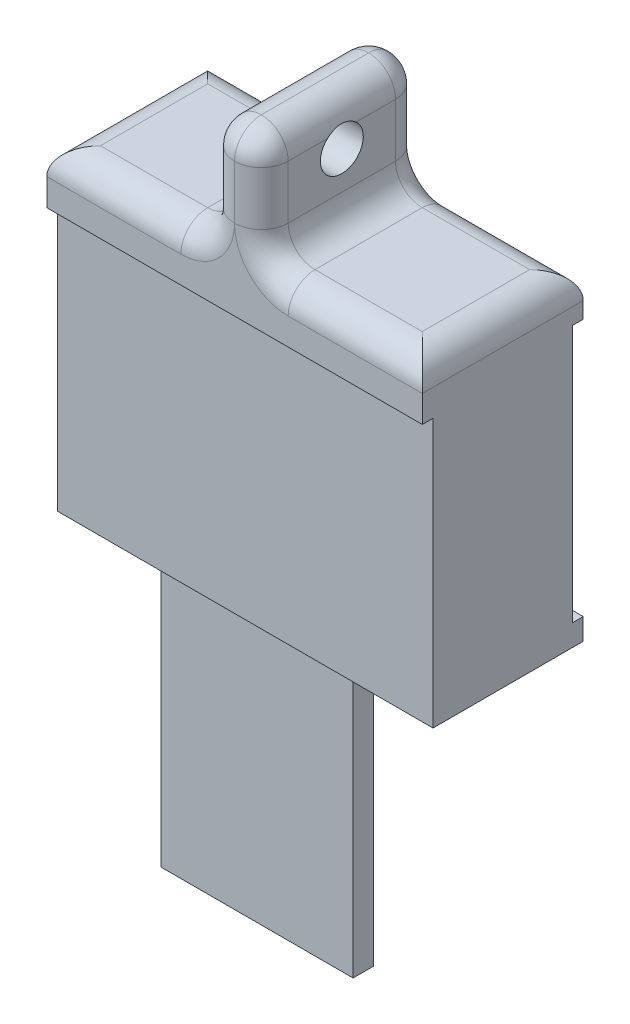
ISO-10303-21;
HEADER;
FILE_DESCRIPTION(('STEP AP214'),'2;1');
FILE_NAME('part.step','',(''),(''),'','','');
FILE_SCHEMA(('AUTOMOTIVE_DESIGN { 1 0 10303 214 1 1 1 1 }'));
ENDSEC;
DATA;
#1=APPLICATION_CONTEXT('core data for automotive mechanical design processes');
#2=APPLICATION_PROTOCOL_DEFINITION('international standard','automotive_design',2000,#1);
#3=PRODUCT_CONTEXT('',#1,'mechanical');
#4=PRODUCT('Part','Part','',(#3));
#5=PRODUCT_RELATED_PRODUCT_CATEGORY('part','',(#4));
#6=PRODUCT_DEFINITION_FORMATION('','',#4);
#7=PRODUCT_DEFINITION_CONTEXT('part definition',#1,'design');
#8=PRODUCT_DEFINITION('design','',#6,#7);
#9=PRODUCT_DEFINITION_SHAPE('','',#8);
#10=(LENGTH_UNIT() NAMED_UNIT(*) SI_UNIT(.MILLI.,.METRE.));
#11=(NAMED_UNIT(*) PLANE_ANGLE_UNIT() SI_UNIT($,.RADIAN.));
#12=(NAMED_UNIT(*) SI_UNIT($,.STERADIAN.) SOLID_ANGLE_UNIT());
#13=UNCERTAINTY_MEASURE_WITH_UNIT(LENGTH_MEASURE(1.E-05),#10,'distance_accuracy_value','');
#14=(GEOMETRIC_REPRESENTATION_CONTEXT(3) GLOBAL_UNCERTAINTY_ASSIGNED_CONTEXT((#13)) GLOBAL_UNIT_ASSIGNED_CONTEXT((#10,
#11,#12)) REPRESENTATION_CONTEXT('',''));
#15=CARTESIAN_POINT('',(0.,0.,0.));
#16=DIRECTION('',(0.,0.,1.));
#17=DIRECTION('',(1.,0.,0.));
#18=AXIS2_PLACEMENT_3D('',#15,#16,#17);
#19=CARTESIAN_POINT('',(0.,0.,0.));
#20=DIRECTION('',(0.,0.,-1.));
#21=DIRECTION('',(-1.,0.,0.));
#22=AXIS2_PLACEMENT_3D('',#19,#20,#21);
#23=PLANE('',#22);
#24=DIRECTION('',(0.,-1.,0.));
#25=VECTOR('',#24,1.);
#26=CARTESIAN_POINT('',(-17.5,-15.,0.));
#27=LINE('',#26,#25);
#28=CARTESIAN_POINT('',(-17.5,12.5,0.));
#29=VERTEX_POINT('',#28);
#30=CARTESIAN_POINT('',(-17.5,11.,0.));
#31=VERTEX_POINT('',#30);
#32=EDGE_CURVE('E584',#29,#31,#27,.T.);
#33=ORIENTED_EDGE('',*,*,#32,.F.);
#34=DIRECTION('',(-1.,0.,0.));
#35=VECTOR('',#34,1.);
#36=CARTESIAN_POINT('',(0.,12.5,0.));
#37=LINE('',#36,#35);
#38=CARTESIAN_POINT('',(-5.,12.5,0.));
#39=VERTEX_POINT('',#38);
#40=EDGE_CURVE('E368',#29,#39,#37,.F.);
#41=ORIENTED_EDGE('',*,*,#40,.T.);
#42=CARTESIAN_POINT('',(-5.,17.5,0.));
#43=DIRECTION('',(0.,0.,-1.));
#44=DIRECTION('',(-1.,0.,0.));
#45=AXIS2_PLACEMENT_3D('',#42,#43,#44);
#46=CIRCLE('',#45,5.);
#47=CARTESIAN_POINT('',(0.,17.5,0.));
#48=VERTEX_POINT('',#47);
#49=EDGE_CURVE('E325',#48,#39,#46,.T.);
#50=ORIENTED_EDGE('',*,*,#49,.F.);
#51=CARTESIAN_POINT('',(5.,17.5,0.));
#52=DIRECTION('',(0.,0.,-1.));
#53=DIRECTION('',(-1.,0.,0.));
#54=AXIS2_PLACEMENT_3D('',#51,#52,#53);
#55=CIRCLE('',#54,5.);
#56=CARTESIAN_POINT('',(5.,12.5,0.));
#57=VERTEX_POINT('',#56);
#58=EDGE_CURVE('E361',#57,#48,#55,.T.);
#59=ORIENTED_EDGE('',*,*,#58,.F.);
#60=DIRECTION('',(1.,0.,0.));
#61=VECTOR('',#60,1.);
#62=CARTESIAN_POINT('',(17.5,12.5,0.));
#63=LINE('',#62,#61);
#64=CARTESIAN_POINT('',(17.5,12.5,0.));
#65=VERTEX_POINT('',#64);
#66=EDGE_CURVE('E366',#57,#65,#63,.T.);
#67=ORIENTED_EDGE('',*,*,#66,.T.);
#68=DIRECTION('',(0.,1.,0.));
#69=VECTOR('',#68,1.);
#70=CARTESIAN_POINT('',(17.5,-15.,0.));
#71=LINE('',#70,#69);
#72=CARTESIAN_POINT('',(17.5,11.,0.));
#73=VERTEX_POINT('',#72);
#74=EDGE_CURVE('E731',#73,#65,#71,.T.);
#75=ORIENTED_EDGE('',*,*,#74,.F.);
#76=DIRECTION('',(1.,0.,0.));
#77=VECTOR('',#76,1.);
#78=CARTESIAN_POINT('',(15.5,11.,0.));
#79=LINE('',#78,#77);
#80=EDGE_CURVE('E586',#31,#73,#79,.T.);
#81=ORIENTED_EDGE('',*,*,#80,.F.);
#82=EDGE_LOOP('',(#33,#41,#50,#59,#67,#75,#81));
#83=FACE_BOUND('',#82,.T.);
#84=ADVANCED_FACE('F39',(#83),#23,.T.);
#85=CARTESIAN_POINT('',(-17.5,-15.,15.));
#86=DIRECTION('',(1.,0.,0.));
#87=DIRECTION('',(0.,0.,-1.));
#88=AXIS2_PLACEMENT_3D('',#85,#86,#87);
#89=PLANE('',#88);
#90=DIRECTION('',(0.,-1.,0.));
#91=VECTOR('',#90,1.);
#92=CARTESIAN_POINT('',(-17.5,-15.,15.));
#93=LINE('',#92,#91);
#94=CARTESIAN_POINT('',(-17.5,12.5,15.));
#95=VERTEX_POINT('',#94);
#96=CARTESIAN_POINT('',(-17.5,10.,15.));
#97=VERTEX_POINT('',#96);
#98=EDGE_CURVE('E735',#95,#97,#93,.T.);
#99=ORIENTED_EDGE('',*,*,#98,.F.);
#100=DIRECTION('',(0.,0.,-1.));
#101=VECTOR('',#100,1.);
#102=CARTESIAN_POINT('',(-17.5,12.5,0.));
#103=LINE('',#102,#101);
#104=EDGE_CURVE('E385',#95,#29,#103,.T.);
#105=ORIENTED_EDGE('',*,*,#104,.T.);
#106=ORIENTED_EDGE('',*,*,#32,.T.);
#107=DIRECTION('',(0.,0.,-1.));
#108=VECTOR('',#107,1.);
#109=CARTESIAN_POINT('',(-17.5,11.,1.));
#110=LINE('',#109,#108);
#111=CARTESIAN_POINT('',(-17.5,11.,1.));
#112=VERTEX_POINT('',#111);
#113=EDGE_CURVE('E626',#112,#31,#110,.T.);
#114=ORIENTED_EDGE('',*,*,#113,.F.);
#115=DIRECTION('',(0.,1.,0.));
#116=VECTOR('',#115,1.);
#117=CARTESIAN_POINT('',(-17.5,11.,1.));
#118=LINE('',#117,#116);
#119=CARTESIAN_POINT('',(-17.5,-13.,1.));
#120=VERTEX_POINT('',#119);
#121=EDGE_CURVE('E615',#120,#112,#118,.T.);
#122=ORIENTED_EDGE('',*,*,#121,.F.);
#123=DIRECTION('',(0.,0.,-1.));
#124=VECTOR('',#123,1.);
#125=CARTESIAN_POINT('',(-17.5,-13.,1.));
#126=LINE('',#125,#124);
#127=CARTESIAN_POINT('',(-17.5,-13.,0.));
#128=VERTEX_POINT('',#127);
#129=EDGE_CURVE('E628',#120,#128,#126,.T.);
#130=ORIENTED_EDGE('',*,*,#129,.T.);
#131=CARTESIAN_POINT('',(-17.5,-15.,0.));
#132=VERTEX_POINT('',#131);
#133=EDGE_CURVE('E590',#128,#132,#27,.T.);
#134=ORIENTED_EDGE('',*,*,#133,.T.);
#135=DIRECTION('',(0.,0.,-1.));
#136=VECTOR('',#135,1.);
#137=CARTESIAN_POINT('',(-17.5,-15.,15.));
#138=LINE('',#137,#136);
#139=CARTESIAN_POINT('',(-17.5,-15.,14.));
#140=VERTEX_POINT('',#139);
#141=EDGE_CURVE('E744',#140,#132,#138,.T.);
#142=ORIENTED_EDGE('',*,*,#141,.F.);
#143=DIRECTION('',(0.,-1.,0.));
#144=VECTOR('',#143,1.);
#145=CARTESIAN_POINT('',(-17.5,-15.,14.));
#146=LINE('',#145,#144);
#147=CARTESIAN_POINT('',(-17.5,10.,14.));
#148=VERTEX_POINT('',#147);
#149=EDGE_CURVE('E668',#148,#140,#146,.T.);
#150=ORIENTED_EDGE('',*,*,#149,.F.);
#151=DIRECTION('',(0.,0.,1.));
#152=VECTOR('',#151,1.);
#153=CARTESIAN_POINT('',(-17.5,10.,14.));
#154=LINE('',#153,#152);
#155=EDGE_CURVE('E680',#148,#97,#154,.T.);
#156=ORIENTED_EDGE('',*,*,#155,.T.);
#157=EDGE_LOOP('',(#99,#105,#106,#114,#122,#130,#134,#142,#150,#156));
#158=FACE_BOUND('',#157,.T.);
#159=ADVANCED_FACE('F503',(#158),#89,.F.);
#160=CARTESIAN_POINT('',(0.,0.,15.));
#161=DIRECTION('',(0.,0.,-1.));
#162=DIRECTION('',(-1.,0.,0.));
#163=AXIS2_PLACEMENT_3D('',#160,#161,#162);
#164=PLANE('',#163);
#165=DIRECTION('',(0.,1.,0.));
#166=VECTOR('',#165,1.);
#167=CARTESIAN_POINT('',(17.5,-15.,15.));
#168=LINE('',#167,#166);
#169=CARTESIAN_POINT('',(17.5,10.,15.));
#170=VERTEX_POINT('',#169);
#171=CARTESIAN_POINT('',(17.5,12.5,15.));
#172=VERTEX_POINT('',#171);
#173=EDGE_CURVE('E732',#170,#172,#168,.T.);
#174=ORIENTED_EDGE('',*,*,#173,.T.);
#175=DIRECTION('',(1.,0.,0.));
#176=VECTOR('',#175,1.);
#177=CARTESIAN_POINT('',(0.,12.5,15.));
#178=LINE('',#177,#176);
#179=CARTESIAN_POINT('',(5.,12.5,15.));
#180=VERTEX_POINT('',#179);
#181=EDGE_CURVE('E800',#172,#180,#178,.F.);
#182=ORIENTED_EDGE('',*,*,#181,.T.);
#183=CARTESIAN_POINT('',(5.,17.5,15.));
#184=DIRECTION('',(0.,0.,-1.));
#185=DIRECTION('',(-1.,0.,0.));
#186=AXIS2_PLACEMENT_3D('',#183,#184,#185);
#187=CIRCLE('',#186,5.);
#188=CARTESIAN_POINT('',(0.,17.5,15.));
#189=VERTEX_POINT('',#188);
#190=EDGE_CURVE('E797',#189,#180,#187,.F.);
#191=ORIENTED_EDGE('',*,*,#190,.F.);
#192=CARTESIAN_POINT('',(-5.,17.5,15.));
#193=DIRECTION('',(0.,0.,-1.));
#194=DIRECTION('',(-1.,0.,0.));
#195=AXIS2_PLACEMENT_3D('',#192,#193,#194);
#196=CIRCLE('',#195,5.);
#197=CARTESIAN_POINT('',(-5.,12.5,15.));
#198=VERTEX_POINT('',#197);
#199=EDGE_CURVE('E794',#198,#189,#196,.F.);
#200=ORIENTED_EDGE('',*,*,#199,.F.);
#201=DIRECTION('',(-1.,0.,0.));
#202=VECTOR('',#201,1.);
#203=CARTESIAN_POINT('',(-17.5,12.5,15.));
#204=LINE('',#203,#202);
#205=EDGE_CURVE('E792',#198,#95,#204,.T.);
#206=ORIENTED_EDGE('',*,*,#205,.T.);
#207=ORIENTED_EDGE('',*,*,#98,.T.);
#208=DIRECTION('',(-1.,0.,0.));
#209=VECTOR('',#208,1.);
#210=CARTESIAN_POINT('',(-17.5,10.,15.));
#211=LINE('',#210,#209);
#212=EDGE_CURVE('E659',#170,#97,#211,.T.);
#213=ORIENTED_EDGE('',*,*,#212,.F.);
#214=EDGE_LOOP('',(#174,#182,#191,#200,#206,#207,#213));
#215=FACE_BOUND('',#214,.T.);
#216=ADVANCED_FACE('F459',(#215),#164,.F.);
#217=CARTESIAN_POINT('',(15.5,11.,10.));
#218=DIRECTION('',(1.,0.,0.));
#219=DIRECTION('',(0.,1.,0.));
#220=AXIS2_PLACEMENT_3D('',#217,#218,#219);
#221=PLANE('',#220);
#222=DIRECTION('',(0.,1.,0.));
#223=VECTOR('',#222,1.);
#224=CARTESIAN_POINT('',(15.5,11.,0.999999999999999));
#225=LINE('',#224,#223);
#226=CARTESIAN_POINT('',(15.5,-13.,0.999999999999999));
#227=VERTEX_POINT('',#226);
#228=CARTESIAN_POINT('',(15.5,11.,1.));
#229=VERTEX_POINT('',#228);
#230=EDGE_CURVE('E633',#227,#229,#225,.T.);
#231=ORIENTED_EDGE('',*,*,#230,.F.);
#232=DIRECTION('',(0.,0.,-1.));
#233=VECTOR('',#232,1.);
#234=CARTESIAN_POINT('',(15.5,-13.,10.));
#235=LINE('',#234,#233);
#236=CARTESIAN_POINT('',(15.5,-13.,10.));
#237=VERTEX_POINT('',#236);
#238=EDGE_CURVE('E653',#237,#227,#235,.T.);
#239=ORIENTED_EDGE('',*,*,#238,.F.);
#240=DIRECTION('',(0.,-1.,0.));
#241=VECTOR('',#240,1.);
#242=CARTESIAN_POINT('',(15.5,11.,10.));
#243=LINE('',#242,#241);
#244=CARTESIAN_POINT('',(15.5,11.,10.));
#245=VERTEX_POINT('',#244);
#246=EDGE_CURVE('E641',#245,#237,#243,.T.);
#247=ORIENTED_EDGE('',*,*,#246,.F.);
#248=DIRECTION('',(0.,0.,-1.));
#249=VECTOR('',#248,1.);
#250=CARTESIAN_POINT('',(15.5,11.,10.));
#251=LINE('',#250,#249);
#252=EDGE_CURVE('E656',#245,#229,#251,.T.);
#253=ORIENTED_EDGE('',*,*,#252,.T.);
#254=EDGE_LOOP('',(#231,#239,#247,#253));
#255=FACE_BOUND('',#254,.T.);
#256=ADVANCED_FACE('F452',(#255),#221,.F.);
#257=CARTESIAN_POINT('',(-15.5,11.,10.));
#258=DIRECTION('',(-1.,0.,0.));
#259=DIRECTION('',(0.,-1.,0.));
#260=AXIS2_PLACEMENT_3D('',#257,#258,#259);
#261=PLANE('',#260);
#262=DIRECTION('',(0.,-1.,0.));
#263=VECTOR('',#262,1.);
#264=CARTESIAN_POINT('',(-15.5,11.,0.999999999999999));
#265=LINE('',#264,#263);
#266=CARTESIAN_POINT('',(-15.5,11.,0.999999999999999));
#267=VERTEX_POINT('',#266);
#268=CARTESIAN_POINT('',(-15.5,-13.,1.));
#269=VERTEX_POINT('',#268);
#270=EDGE_CURVE('E625',#267,#269,#265,.T.);
#271=ORIENTED_EDGE('',*,*,#270,.F.);
#272=DIRECTION('',(0.,0.,-1.));
#273=VECTOR('',#272,1.);
#274=CARTESIAN_POINT('',(-15.5,11.,10.));
#275=LINE('',#274,#273);
#276=CARTESIAN_POINT('',(-15.5,11.,10.));
#277=VERTEX_POINT('',#276);
#278=EDGE_CURVE('E660',#277,#267,#275,.T.);
#279=ORIENTED_EDGE('',*,*,#278,.F.);
#280=DIRECTION('',(0.,1.,0.));
#281=VECTOR('',#280,1.);
#282=CARTESIAN_POINT('',(-15.5,11.,10.));
#283=LINE('',#282,#281);
#284=CARTESIAN_POINT('',(-15.5,-13.,10.));
#285=VERTEX_POINT('',#284);
#286=EDGE_CURVE('E647',#285,#277,#283,.T.);
#287=ORIENTED_EDGE('',*,*,#286,.F.);
#288=DIRECTION('',(0.,0.,-1.));
#289=VECTOR('',#288,1.);
#290=CARTESIAN_POINT('',(-15.5,-13.,10.));
#291=LINE('',#290,#289);
#292=EDGE_CURVE('E663',#285,#269,#291,.T.);
#293=ORIENTED_EDGE('',*,*,#292,.T.);
#294=EDGE_LOOP('',(#271,#279,#287,#293));
#295=FACE_BOUND('',#294,.T.);
#296=ADVANCED_FACE('F448',(#295),#261,.F.);
#297=CARTESIAN_POINT('',(-17.5,-15.,15.));
#298=DIRECTION('',(0.,1.,0.));
#299=DIRECTION('',(0.,0.,1.));
#300=AXIS2_PLACEMENT_3D('',#297,#298,#299);
#301=PLANE('',#300);
#302=CARTESIAN_POINT('',(9.5,-15.,5.));
#303=DIRECTION('',(0.,-1.,0.));
#304=DIRECTION('',(0.,0.,-1.));
#305=AXIS2_PLACEMENT_3D('',#302,#303,#304);
#306=CIRCLE('',#305,2.5);
#307=CARTESIAN_POINT('',(9.5,-15.,2.5));
#308=VERTEX_POINT('',#307);
#309=EDGE_CURVE('E883',#308,#308,#306,.T.);
#310=ORIENTED_EDGE('',*,*,#309,.F.);
#311=EDGE_LOOP('',(#310));
#312=FACE_BOUND('',#311,.T.);
#313=CARTESIAN_POINT('',(-9.50000000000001,-15.,5.));
#314=DIRECTION('',(0.,-1.,0.));
#315=DIRECTION('',(0.,0.,-1.));
#316=AXIS2_PLACEMENT_3D('',#313,#314,#315);
#317=CIRCLE('',#316,2.5);
#318=CARTESIAN_POINT('',(-9.50000000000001,-15.,2.5));
#319=VERTEX_POINT('',#318);
#320=EDGE_CURVE('E635',#319,#319,#317,.T.);
#321=ORIENTED_EDGE('',*,*,#320,.F.);
#322=EDGE_LOOP('',(#321));
#323=FACE_BOUND('',#322,.T.);
#324=DIRECTION('',(0.,0.,-1.));
#325=VECTOR('',#324,1.);
#326=CARTESIAN_POINT('',(17.5,-15.,15.));
#327=LINE('',#326,#325);
#328=CARTESIAN_POINT('',(17.5,-15.,14.));
#329=VERTEX_POINT('',#328);
#330=CARTESIAN_POINT('',(17.5,-15.,0.));
#331=VERTEX_POINT('',#330);
#332=EDGE_CURVE('E737',#329,#331,#327,.T.);
#333=ORIENTED_EDGE('',*,*,#332,.F.);
#334=DIRECTION('',(1.,0.,0.));
#335=VECTOR('',#334,1.);
#336=CARTESIAN_POINT('',(-17.5,-15.,14.));
#337=LINE('',#336,#335);
#338=EDGE_CURVE('E670',#140,#329,#337,.T.);
#339=ORIENTED_EDGE('',*,*,#338,.F.);
#340=ORIENTED_EDGE('',*,*,#141,.T.);
#341=DIRECTION('',(1.,0.,0.));
#342=VECTOR('',#341,1.);
#343=CARTESIAN_POINT('',(-17.5,-15.,0.));
#344=LINE('',#343,#342);
#345=EDGE_CURVE('E589',#132,#331,#344,.T.);
#346=ORIENTED_EDGE('',*,*,#345,.T.);
#347=EDGE_LOOP('',(#333,#339,#340,#346));
#348=FACE_BOUND('',#347,.T.);
#349=DIRECTION('',(0.,0.,-1.));
#350=VECTOR('',#349,1.);
#351=CARTESIAN_POINT('',(-1.,-15.,11.));
#352=LINE('',#351,#350);
#353=CARTESIAN_POINT('',(-1.,-15.,10.));
#354=VERTEX_POINT('',#353);
#355=CARTESIAN_POINT('',(-1.,-15.,7.1));
#356=VERTEX_POINT('',#355);
#357=EDGE_CURVE('E683',#354,#356,#352,.T.);
#358=ORIENTED_EDGE('',*,*,#357,.F.);
#359=CARTESIAN_POINT('',(-2.,-15.,10.));
#360=DIRECTION('',(0.,1.,0.));
#361=DIRECTION('',(0.,0.,1.));
#362=AXIS2_PLACEMENT_3D('',#359,#360,#361);
#363=CIRCLE('',#362,1.);
#364=CARTESIAN_POINT('',(-2.,-15.,11.));
#365=VERTEX_POINT('',#364);
#366=EDGE_CURVE('E769',#354,#365,#363,.F.);
#367=ORIENTED_EDGE('',*,*,#366,.T.);
#368=DIRECTION('',(1.,0.,0.));
#369=VECTOR('',#368,1.);
#370=CARTESIAN_POINT('',(-1.,-15.,11.));
#371=LINE('',#370,#369);
#372=CARTESIAN_POINT('',(-8.95,-15.,11.));
#373=VERTEX_POINT('',#372);
#374=EDGE_CURVE('E688',#373,#365,#371,.T.);
#375=ORIENTED_EDGE('',*,*,#374,.F.);
#376=DIRECTION('',(0.,0.,-1.));
#377=VECTOR('',#376,1.);
#378=CARTESIAN_POINT('',(-8.95,-15.,11.));
#379=LINE('',#378,#377);
#380=CARTESIAN_POINT('',(-8.95,-15.,12.9));
#381=VERTEX_POINT('',#380);
#382=EDGE_CURVE('E715',#381,#373,#379,.T.);
#383=ORIENTED_EDGE('',*,*,#382,.F.);
#384=DIRECTION('',(-1.,0.,0.));
#385=VECTOR('',#384,1.);
#386=CARTESIAN_POINT('',(8.95,-15.,12.9));
#387=LINE('',#386,#385);
#388=CARTESIAN_POINT('',(8.95,-15.,12.9));
#389=VERTEX_POINT('',#388);
#390=EDGE_CURVE('E712',#389,#381,#387,.T.);
#391=ORIENTED_EDGE('',*,*,#390,.F.);
#392=DIRECTION('',(0.,0.,1.));
#393=VECTOR('',#392,1.);
#394=CARTESIAN_POINT('',(8.95,-15.,11.));
#395=LINE('',#394,#393);
#396=CARTESIAN_POINT('',(8.95,-15.,11.));
#397=VERTEX_POINT('',#396);
#398=EDGE_CURVE('E709',#397,#389,#395,.T.);
#399=ORIENTED_EDGE('',*,*,#398,.F.);
#400=DIRECTION('',(1.,0.,0.));
#401=VECTOR('',#400,1.);
#402=CARTESIAN_POINT('',(8.95,-15.,11.));
#403=LINE('',#402,#401);
#404=CARTESIAN_POINT('',(1.9,-15.,11.));
#405=VERTEX_POINT('',#404);
#406=EDGE_CURVE('E707',#405,#397,#403,.T.);
#407=ORIENTED_EDGE('',*,*,#406,.F.);
#408=CARTESIAN_POINT('',(1.9,-15.,10.));
#409=DIRECTION('',(0.,1.,0.));
#410=DIRECTION('',(0.,0.,1.));
#411=AXIS2_PLACEMENT_3D('',#408,#409,#410);
#412=CIRCLE('',#411,1.);
#413=CARTESIAN_POINT('',(0.899999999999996,-15.,10.));
#414=VERTEX_POINT('',#413);
#415=EDGE_CURVE('E767',#405,#414,#412,.F.);
#416=ORIENTED_EDGE('',*,*,#415,.T.);
#417=DIRECTION('',(0.,0.,1.));
#418=VECTOR('',#417,1.);
#419=CARTESIAN_POINT('',(0.899999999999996,-15.,11.));
#420=LINE('',#419,#418);
#421=CARTESIAN_POINT('',(0.899999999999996,-15.,7.1));
#422=VERTEX_POINT('',#421);
#423=EDGE_CURVE('E704',#422,#414,#420,.T.);
#424=ORIENTED_EDGE('',*,*,#423,.F.);
#425=CARTESIAN_POINT('',(-0.100000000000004,-15.,7.1));
#426=DIRECTION('',(0.,1.,0.));
#427=DIRECTION('',(0.,0.,1.));
#428=AXIS2_PLACEMENT_3D('',#425,#426,#427);
#429=CIRCLE('',#428,1.);
#430=CARTESIAN_POINT('',(-0.0500000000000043,-15.,6.10125078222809));
#431=VERTEX_POINT('',#430);
#432=EDGE_CURVE('E757',#422,#431,#429,.T.);
#433=ORIENTED_EDGE('',*,*,#432,.T.);
#434=CARTESIAN_POINT('',(0.,-15.,7.1));
#435=DIRECTION('',(0.,1.,0.));
#436=DIRECTION('',(0.,0.,1.));
#437=AXIS2_PLACEMENT_3D('',#434,#435,#436);
#438=CIRCLE('',#437,1.);
#439=EDGE_CURVE('E759',#431,#356,#438,.T.);
#440=ORIENTED_EDGE('',*,*,#439,.T.);
#441=EDGE_LOOP('',(#358,#367,#375,#383,#391,#399,#407,#416,#424,#433,#440));
#442=FACE_BOUND('',#441,.T.);
#443=ADVANCED_FACE('F451',(#312,#323,#348,#442),#301,.F.);
#444=CARTESIAN_POINT('',(17.5,-15.,15.));
#445=DIRECTION('',(-1.,0.,0.));
#446=DIRECTION('',(0.,0.,1.));
#447=AXIS2_PLACEMENT_3D('',#444,#445,#446);
#448=PLANE('',#447);
#449=ORIENTED_EDGE('',*,*,#74,.T.);
#450=DIRECTION('',(0.,0.,-1.));
#451=VECTOR('',#450,1.);
#452=CARTESIAN_POINT('',(17.5,12.5,15.));
#453=LINE('',#452,#451);
#454=EDGE_CURVE('E387',#65,#172,#453,.F.);
#455=ORIENTED_EDGE('',*,*,#454,.T.);
#456=ORIENTED_EDGE('',*,*,#173,.F.);
#457=DIRECTION('',(0.,0.,1.));
#458=VECTOR('',#457,1.);
#459=CARTESIAN_POINT('',(17.5,10.,14.));
#460=LINE('',#459,#458);
#461=CARTESIAN_POINT('',(17.5,10.,14.));
#462=VERTEX_POINT('',#461);
#463=EDGE_CURVE('E677',#462,#170,#460,.T.);
#464=ORIENTED_EDGE('',*,*,#463,.F.);
#465=DIRECTION('',(0.,1.,0.));
#466=VECTOR('',#465,1.);
#467=CARTESIAN_POINT('',(17.5,-15.,14.));
#468=LINE('',#467,#466);
#469=EDGE_CURVE('E672',#329,#462,#468,.T.);
#470=ORIENTED_EDGE('',*,*,#469,.F.);
#471=ORIENTED_EDGE('',*,*,#332,.T.);
#472=CARTESIAN_POINT('',(17.5,-13.,0.));
#473=VERTEX_POINT('',#472);
#474=EDGE_CURVE('E738',#331,#473,#71,.T.);
#475=ORIENTED_EDGE('',*,*,#474,.T.);
#476=DIRECTION('',(0.,0.,-1.));
#477=VECTOR('',#476,1.);
#478=CARTESIAN_POINT('',(17.5,-13.,1.));
#479=LINE('',#478,#477);
#480=CARTESIAN_POINT('',(17.5,-13.,1.));
#481=VERTEX_POINT('',#480);
#482=EDGE_CURVE('E621',#481,#473,#479,.T.);
#483=ORIENTED_EDGE('',*,*,#482,.F.);
#484=DIRECTION('',(0.,-1.,0.));
#485=VECTOR('',#484,1.);
#486=CARTESIAN_POINT('',(17.5,11.,1.));
#487=LINE('',#486,#485);
#488=CARTESIAN_POINT('',(17.5,11.,1.));
#489=VERTEX_POINT('',#488);
#490=EDGE_CURVE('E609',#489,#481,#487,.T.);
#491=ORIENTED_EDGE('',*,*,#490,.F.);
#492=DIRECTION('',(0.,0.,-1.));
#493=VECTOR('',#492,1.);
#494=CARTESIAN_POINT('',(17.5,11.,1.));
#495=LINE('',#494,#493);
#496=EDGE_CURVE('E622',#489,#73,#495,.T.);
#497=ORIENTED_EDGE('',*,*,#496,.T.);
#498=EDGE_LOOP('',(#449,#455,#456,#464,#470,#471,#475,#483,#491,#497));
#499=FACE_BOUND('',#498,.T.);
#500=ADVANCED_FACE('F507',(#499),#448,.F.);
#501=DIRECTION('',(-1.,0.,0.));
#502=VECTOR('',#501,1.);
#503=CARTESIAN_POINT('',(15.5,-13.,0.));
#504=LINE('',#503,#502);
#505=EDGE_CURVE('E90',#473,#128,#504,.T.);
#506=ORIENTED_EDGE('',*,*,#505,.F.);
#507=ORIENTED_EDGE('',*,*,#474,.F.);
#508=ORIENTED_EDGE('',*,*,#345,.F.);
#509=ORIENTED_EDGE('',*,*,#133,.F.);
#510=EDGE_LOOP('',(#506,#507,#508,#509));
#511=FACE_BOUND('',#510,.T.);
#512=ADVANCED_FACE('F499',(#511),#23,.T.);
#513=CARTESIAN_POINT('',(-1.,-40.,11.));
#514=DIRECTION('',(1.,0.,0.));
#515=DIRECTION('',(0.,0.,-1.));
#516=AXIS2_PLACEMENT_3D('',#513,#514,#515);
#517=PLANE('',#516);
#518=DIRECTION('',(0.,0.,-1.));
#519=VECTOR('',#518,1.);
#520=CARTESIAN_POINT('',(-1.,-40.,11.));
#521=LINE('',#520,#519);
#522=CARTESIAN_POINT('',(-1.,-40.,10.));
#523=VERTEX_POINT('',#522);
#524=CARTESIAN_POINT('',(-1.,-40.,7.1));
#525=VERTEX_POINT('',#524);
#526=EDGE_CURVE('E685',#523,#525,#521,.T.);
#527=ORIENTED_EDGE('',*,*,#526,.F.);
#528=DIRECTION('',(0.,1.,0.));
#529=VECTOR('',#528,1.);
#530=CARTESIAN_POINT('',(-1.,-15.,10.));
#531=LINE('',#530,#529);
#532=EDGE_CURVE('E762',#523,#354,#531,.T.);
#533=ORIENTED_EDGE('',*,*,#532,.T.);
#534=ORIENTED_EDGE('',*,*,#357,.T.);
#535=DIRECTION('',(0.,1.,0.));
#536=VECTOR('',#535,1.);
#537=CARTESIAN_POINT('',(-1.,-40.,7.1));
#538=LINE('',#537,#536);
#539=EDGE_CURVE('E754',#356,#525,#538,.F.);
#540=ORIENTED_EDGE('',*,*,#539,.T.);
#541=EDGE_LOOP('',(#527,#533,#534,#540));
#542=FACE_BOUND('',#541,.T.);
#543=ADVANCED_FACE('F495',(#542),#517,.F.);
#544=CARTESIAN_POINT('',(0.899999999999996,-40.,11.));
#545=DIRECTION('',(-1.,0.,0.));
#546=DIRECTION('',(0.,0.,1.));
#547=AXIS2_PLACEMENT_3D('',#544,#545,#546);
#548=PLANE('',#547);
#549=ORIENTED_EDGE('',*,*,#423,.T.);
#550=DIRECTION('',(0.,1.,0.));
#551=VECTOR('',#550,1.);
#552=CARTESIAN_POINT('',(0.899999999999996,-40.,10.));
#553=LINE('',#552,#551);
#554=CARTESIAN_POINT('',(0.899999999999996,-40.,10.));
#555=VERTEX_POINT('',#554);
#556=EDGE_CURVE('E776',#414,#555,#553,.F.);
#557=ORIENTED_EDGE('',*,*,#556,.T.);
#558=DIRECTION('',(0.,0.,1.));
#559=VECTOR('',#558,1.);
#560=CARTESIAN_POINT('',(0.899999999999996,-40.,11.));
#561=LINE('',#560,#559);
#562=CARTESIAN_POINT('',(0.899999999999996,-40.,7.1));
#563=VERTEX_POINT('',#562);
#564=EDGE_CURVE('E687',#563,#555,#561,.T.);
#565=ORIENTED_EDGE('',*,*,#564,.F.);
#566=DIRECTION('',(0.,1.,0.));
#567=VECTOR('',#566,1.);
#568=CARTESIAN_POINT('',(0.899999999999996,-40.,7.1));
#569=LINE('',#568,#567);
#570=EDGE_CURVE('E747',#563,#422,#569,.T.);
#571=ORIENTED_EDGE('',*,*,#570,.T.);
#572=EDGE_LOOP('',(#549,#557,#565,#571));
#573=FACE_BOUND('',#572,.T.);
#574=ADVANCED_FACE('F491',(#573),#548,.F.);
#575=CARTESIAN_POINT('',(8.95,-40.,11.));
#576=DIRECTION('',(0.,0.,1.));
#577=DIRECTION('',(1.,0.,0.));
#578=AXIS2_PLACEMENT_3D('',#575,#576,#577);
#579=PLANE('',#578);
#580=DIRECTION('',(1.,0.,0.));
#581=VECTOR('',#580,1.);
#582=CARTESIAN_POINT('',(8.95,-40.,11.));
#583=LINE('',#582,#581);
#584=CARTESIAN_POINT('',(1.9,-40.,11.));
#585=VERTEX_POINT('',#584);
#586=CARTESIAN_POINT('',(8.95,-40.,11.));
#587=VERTEX_POINT('',#586);
#588=EDGE_CURVE('E691',#585,#587,#583,.T.);
#589=ORIENTED_EDGE('',*,*,#588,.F.);
#590=DIRECTION('',(0.,1.,0.));
#591=VECTOR('',#590,1.);
#592=CARTESIAN_POINT('',(1.9,-15.,11.));
#593=LINE('',#592,#591);
#594=EDGE_CURVE('E773',#585,#405,#593,.T.);
#595=ORIENTED_EDGE('',*,*,#594,.T.);
#596=ORIENTED_EDGE('',*,*,#406,.T.);
#597=DIRECTION('',(0.,1.,0.));
#598=VECTOR('',#597,1.);
#599=CARTESIAN_POINT('',(8.95,-40.,11.));
#600=LINE('',#599,#598);
#601=EDGE_CURVE('E728',#587,#397,#600,.T.);
#602=ORIENTED_EDGE('',*,*,#601,.F.);
#603=EDGE_LOOP('',(#589,#595,#596,#602));
#604=FACE_BOUND('',#603,.T.);
#605=ADVANCED_FACE('F487',(#604),#579,.F.);
#606=CARTESIAN_POINT('',(8.95,-40.,11.));
#607=DIRECTION('',(-1.,0.,0.));
#608=DIRECTION('',(0.,0.,1.));
#609=AXIS2_PLACEMENT_3D('',#606,#607,#608);
#610=PLANE('',#609);
#611=ORIENTED_EDGE('',*,*,#398,.T.);
#612=DIRECTION('',(0.,1.,0.));
#613=VECTOR('',#612,1.);
#614=CARTESIAN_POINT('',(8.95,-40.,12.9));
#615=LINE('',#614,#613);
#616=CARTESIAN_POINT('',(8.95,-40.,12.9));
#617=VERTEX_POINT('',#616);
#618=EDGE_CURVE('E725',#617,#389,#615,.T.);
#619=ORIENTED_EDGE('',*,*,#618,.F.);
#620=DIRECTION('',(0.,0.,1.));
#621=VECTOR('',#620,1.);
#622=CARTESIAN_POINT('',(8.95,-40.,11.));
#623=LINE('',#622,#621);
#624=EDGE_CURVE('E693',#587,#617,#623,.T.);
#625=ORIENTED_EDGE('',*,*,#624,.F.);
#626=ORIENTED_EDGE('',*,*,#601,.T.);
#627=EDGE_LOOP('',(#611,#619,#625,#626));
#628=FACE_BOUND('',#627,.T.);
#629=ADVANCED_FACE('F483',(#628),#610,.F.);
#630=CARTESIAN_POINT('',(8.95,-40.,12.9));
#631=DIRECTION('',(0.,0.,-1.));
#632=DIRECTION('',(-1.,0.,0.));
#633=AXIS2_PLACEMENT_3D('',#630,#631,#632);
#634=PLANE('',#633);
#635=ORIENTED_EDGE('',*,*,#390,.T.);
#636=DIRECTION('',(0.,1.,0.));
#637=VECTOR('',#636,1.);
#638=CARTESIAN_POINT('',(-8.95,-40.,12.9));
#639=LINE('',#638,#637);
#640=CARTESIAN_POINT('',(-8.95,-40.,12.9));
#641=VERTEX_POINT('',#640);
#642=EDGE_CURVE('E722',#641,#381,#639,.T.);
#643=ORIENTED_EDGE('',*,*,#642,.F.);
#644=DIRECTION('',(-1.,0.,0.));
#645=VECTOR('',#644,1.);
#646=CARTESIAN_POINT('',(8.95,-40.,12.9));
#647=LINE('',#646,#645);
#648=EDGE_CURVE('E695',#617,#641,#647,.T.);
#649=ORIENTED_EDGE('',*,*,#648,.F.);
#650=ORIENTED_EDGE('',*,*,#618,.T.);
#651=EDGE_LOOP('',(#635,#643,#649,#650));
#652=FACE_BOUND('',#651,.T.);
#653=ADVANCED_FACE('F479',(#652),#634,.F.);
#654=CARTESIAN_POINT('',(-8.95,-40.,11.));
#655=DIRECTION('',(1.,0.,0.));
#656=DIRECTION('',(0.,0.,-1.));
#657=AXIS2_PLACEMENT_3D('',#654,#655,#656);
#658=PLANE('',#657);
#659=ORIENTED_EDGE('',*,*,#382,.T.);
#660=DIRECTION('',(0.,1.,0.));
#661=VECTOR('',#660,1.);
#662=CARTESIAN_POINT('',(-8.95,-40.,11.));
#663=LINE('',#662,#661);
#664=CARTESIAN_POINT('',(-8.95,-40.,11.));
#665=VERTEX_POINT('',#664);
#666=EDGE_CURVE('E702',#665,#373,#663,.T.);
#667=ORIENTED_EDGE('',*,*,#666,.F.);
#668=DIRECTION('',(0.,0.,-1.));
#669=VECTOR('',#668,1.);
#670=CARTESIAN_POINT('',(-8.95,-40.,11.));
#671=LINE('',#670,#669);
#672=EDGE_CURVE('E697',#641,#665,#671,.T.);
#673=ORIENTED_EDGE('',*,*,#672,.F.);
#674=ORIENTED_EDGE('',*,*,#642,.T.);
#675=EDGE_LOOP('',(#659,#667,#673,#674));
#676=FACE_BOUND('',#675,.T.);
#677=ADVANCED_FACE('F475',(#676),#658,.F.);
#678=CARTESIAN_POINT('',(-1.,-40.,11.));
#679=DIRECTION('',(0.,0.,1.));
#680=DIRECTION('',(1.,0.,0.));
#681=AXIS2_PLACEMENT_3D('',#678,#679,#680);
#682=PLANE('',#681);
#683=ORIENTED_EDGE('',*,*,#374,.T.);
#684=DIRECTION('',(0.,1.,0.));
#685=VECTOR('',#684,1.);
#686=CARTESIAN_POINT('',(-2.,-40.,11.));
#687=LINE('',#686,#685);
#688=CARTESIAN_POINT('',(-2.,-40.,11.));
#689=VERTEX_POINT('',#688);
#690=EDGE_CURVE('E771',#365,#689,#687,.F.);
#691=ORIENTED_EDGE('',*,*,#690,.T.);
#692=DIRECTION('',(1.,0.,0.));
#693=VECTOR('',#692,1.);
#694=CARTESIAN_POINT('',(-1.,-40.,11.));
#695=LINE('',#694,#693);
#696=EDGE_CURVE('E699',#665,#689,#695,.T.);
#697=ORIENTED_EDGE('',*,*,#696,.F.);
#698=ORIENTED_EDGE('',*,*,#666,.T.);
#699=EDGE_LOOP('',(#683,#691,#697,#698));
#700=FACE_BOUND('',#699,.T.);
#701=ADVANCED_FACE('F471',(#700),#682,.F.);
#702=CARTESIAN_POINT('',(0.,-40.,0.));
#703=DIRECTION('',(0.,-1.,0.));
#704=DIRECTION('',(0.,0.,-1.));
#705=AXIS2_PLACEMENT_3D('',#702,#703,#704);
#706=PLANE('',#705);
#707=CARTESIAN_POINT('',(0.,-40.,7.1));
#708=DIRECTION('',(0.,-1.,0.));
#709=DIRECTION('',(0.,0.,-1.));
#710=AXIS2_PLACEMENT_3D('',#707,#708,#709);
#711=CIRCLE('',#710,1.);
#712=CARTESIAN_POINT('',(-0.0500000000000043,-40.,6.10125078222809));
#713=VERTEX_POINT('',#712);
#714=EDGE_CURVE('E750',#525,#713,#711,.T.);
#715=ORIENTED_EDGE('',*,*,#714,.T.);
#716=CARTESIAN_POINT('',(-0.100000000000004,-40.,7.1));
#717=DIRECTION('',(0.,-1.,0.));
#718=DIRECTION('',(0.,0.,-1.));
#719=AXIS2_PLACEMENT_3D('',#716,#717,#718);
#720=CIRCLE('',#719,1.);
#721=EDGE_CURVE('E752',#713,#563,#720,.T.);
#722=ORIENTED_EDGE('',*,*,#721,.T.);
#723=ORIENTED_EDGE('',*,*,#564,.T.);
#724=CARTESIAN_POINT('',(1.9,-40.,10.));
#725=DIRECTION('',(0.,-1.,0.));
#726=DIRECTION('',(0.,0.,-1.));
#727=AXIS2_PLACEMENT_3D('',#724,#725,#726);
#728=CIRCLE('',#727,1.);
#729=EDGE_CURVE('E780',#555,#585,#728,.F.);
#730=ORIENTED_EDGE('',*,*,#729,.T.);
#731=ORIENTED_EDGE('',*,*,#588,.T.);
#732=ORIENTED_EDGE('',*,*,#624,.T.);
#733=ORIENTED_EDGE('',*,*,#648,.T.);
#734=ORIENTED_EDGE('',*,*,#672,.T.);
#735=ORIENTED_EDGE('',*,*,#696,.T.);
#736=CARTESIAN_POINT('',(-2.,-40.,10.));
#737=DIRECTION('',(0.,-1.,0.));
#738=DIRECTION('',(0.,0.,-1.));
#739=AXIS2_PLACEMENT_3D('',#736,#737,#738);
#740=CIRCLE('',#739,1.);
#741=EDGE_CURVE('E778',#689,#523,#740,.F.);
#742=ORIENTED_EDGE('',*,*,#741,.T.);
#743=ORIENTED_EDGE('',*,*,#526,.T.);
#744=EDGE_LOOP('',(#715,#722,#723,#730,#731,#732,#733,#734,#735,#742,#743));
#745=FACE_BOUND('',#744,.T.);
#746=ADVANCED_FACE('F467',(#745),#706,.T.);
#747=CARTESIAN_POINT('',(-17.5,10.,14.));
#748=DIRECTION('',(0.,1.,0.));
#749=DIRECTION('',(0.,0.,1.));
#750=AXIS2_PLACEMENT_3D('',#747,#748,#749);
#751=PLANE('',#750);
#752=ORIENTED_EDGE('',*,*,#212,.T.);
#753=ORIENTED_EDGE('',*,*,#155,.F.);
#754=DIRECTION('',(-1.,0.,0.));
#755=VECTOR('',#754,1.);
#756=CARTESIAN_POINT('',(-17.5,10.,14.));
#757=LINE('',#756,#755);
#758=EDGE_CURVE('E674',#462,#148,#757,.T.);
#759=ORIENTED_EDGE('',*,*,#758,.F.);
#760=ORIENTED_EDGE('',*,*,#463,.T.);
#761=EDGE_LOOP('',(#752,#753,#759,#760));
#762=FACE_BOUND('',#761,.T.);
#763=ADVANCED_FACE('F463',(#762),#751,.F.);
#764=CARTESIAN_POINT('',(0.,0.,14.));
#765=DIRECTION('',(0.,0.,-1.));
#766=DIRECTION('',(-1.,0.,0.));
#767=AXIS2_PLACEMENT_3D('',#764,#765,#766);
#768=PLANE('',#767);
#769=ORIENTED_EDGE('',*,*,#149,.T.);
#770=ORIENTED_EDGE('',*,*,#338,.T.);
#771=ORIENTED_EDGE('',*,*,#469,.T.);
#772=ORIENTED_EDGE('',*,*,#758,.T.);
#773=EDGE_LOOP('',(#769,#770,#771,#772));
#774=FACE_BOUND('',#773,.T.);
#775=ADVANCED_FACE('F446',(#774),#768,.F.);
#776=CARTESIAN_POINT('',(15.5,11.,10.));
#777=DIRECTION('',(0.,1.,0.));
#778=DIRECTION('',(0.,0.,1.));
#779=AXIS2_PLACEMENT_3D('',#776,#777,#778);
#780=PLANE('',#779);
#781=ORIENTED_EDGE('',*,*,#80,.T.);
#782=ORIENTED_EDGE('',*,*,#496,.F.);
#783=DIRECTION('',(1.,0.,0.));
#784=VECTOR('',#783,1.);
#785=CARTESIAN_POINT('',(17.5,11.,1.));
#786=LINE('',#785,#784);
#787=EDGE_CURVE('E618',#229,#489,#786,.T.);
#788=ORIENTED_EDGE('',*,*,#787,.F.);
#789=ORIENTED_EDGE('',*,*,#252,.F.);
#790=DIRECTION('',(1.,0.,0.));
#791=VECTOR('',#790,1.);
#792=CARTESIAN_POINT('',(15.5,11.,10.));
#793=LINE('',#792,#791);
#794=EDGE_CURVE('E650',#277,#245,#793,.T.);
#795=ORIENTED_EDGE('',*,*,#794,.F.);
#796=ORIENTED_EDGE('',*,*,#278,.T.);
#797=EDGE_CURVE('E619',#112,#267,#786,.T.);
#798=ORIENTED_EDGE('',*,*,#797,.F.);
#799=ORIENTED_EDGE('',*,*,#113,.T.);
#800=EDGE_LOOP('',(#781,#782,#788,#789,#795,#796,#798,#799));
#801=FACE_BOUND('',#800,.T.);
#802=ADVANCED_FACE('F443',(#801),#780,.F.);
#803=CARTESIAN_POINT('',(15.5,-13.,10.));
#804=DIRECTION('',(0.,-1.,0.));
#805=DIRECTION('',(0.,0.,-1.));
#806=AXIS2_PLACEMENT_3D('',#803,#804,#805);
#807=PLANE('',#806);
#808=CARTESIAN_POINT('',(9.5,-13.,5.));
#809=DIRECTION('',(0.,-1.,0.));
#810=DIRECTION('',(0.,0.,-1.));
#811=AXIS2_PLACEMENT_3D('',#808,#809,#810);
#812=CIRCLE('',#811,2.5);
#813=CARTESIAN_POINT('',(9.5,-13.,2.5));
#814=VERTEX_POINT('',#813);
#815=EDGE_CURVE('E606',#814,#814,#812,.F.);
#816=ORIENTED_EDGE('',*,*,#815,.F.);
#817=EDGE_LOOP('',(#816));
#818=FACE_BOUND('',#817,.T.);
#819=ORIENTED_EDGE('',*,*,#505,.T.);
#820=ORIENTED_EDGE('',*,*,#129,.F.);
#821=DIRECTION('',(-1.,0.,0.));
#822=VECTOR('',#821,1.);
#823=CARTESIAN_POINT('',(17.5,-13.,1.));
#824=LINE('',#823,#822);
#825=EDGE_CURVE('E612',#269,#120,#824,.T.);
#826=ORIENTED_EDGE('',*,*,#825,.F.);
#827=ORIENTED_EDGE('',*,*,#292,.F.);
#828=DIRECTION('',(-1.,0.,0.));
#829=VECTOR('',#828,1.);
#830=CARTESIAN_POINT('',(15.5,-13.,10.));
#831=LINE('',#830,#829);
#832=EDGE_CURVE('E644',#237,#285,#831,.T.);
#833=ORIENTED_EDGE('',*,*,#832,.F.);
#834=ORIENTED_EDGE('',*,*,#238,.T.);
#835=EDGE_CURVE('E613',#481,#227,#824,.T.);
#836=ORIENTED_EDGE('',*,*,#835,.F.);
#837=ORIENTED_EDGE('',*,*,#482,.T.);
#838=EDGE_LOOP('',(#819,#820,#826,#827,#833,#834,#836,#837));
#839=FACE_BOUND('',#838,.T.);
#840=CARTESIAN_POINT('',(-9.50000000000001,-13.,5.));
#841=DIRECTION('',(0.,-1.,0.));
#842=DIRECTION('',(0.,0.,-1.));
#843=AXIS2_PLACEMENT_3D('',#840,#841,#842);
#844=CIRCLE('',#843,2.5);
#845=CARTESIAN_POINT('',(-9.50000000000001,-13.,2.5));
#846=VERTEX_POINT('',#845);
#847=EDGE_CURVE('E638',#846,#846,#844,.F.);
#848=ORIENTED_EDGE('',*,*,#847,.F.);
#849=EDGE_LOOP('',(#848));
#850=FACE_BOUND('',#849,.T.);
#851=ADVANCED_FACE('F441',(#818,#839,#850),#807,.F.);
#852=CARTESIAN_POINT('',(0.,0.,10.));
#853=DIRECTION('',(0.,0.,-1.));
#854=DIRECTION('',(-1.,0.,0.));
#855=AXIS2_PLACEMENT_3D('',#852,#853,#854);
#856=PLANE('',#855);
#857=ORIENTED_EDGE('',*,*,#246,.T.);
#858=ORIENTED_EDGE('',*,*,#832,.T.);
#859=ORIENTED_EDGE('',*,*,#286,.T.);
#860=ORIENTED_EDGE('',*,*,#794,.T.);
#861=EDGE_LOOP('',(#857,#858,#859,#860));
#862=FACE_BOUND('',#861,.T.);
#863=ADVANCED_FACE('F437',(#862),#856,.T.);
#864=CARTESIAN_POINT('',(-9.50000000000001,-5.92893218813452,5.));
#865=DIRECTION('',(0.,-1.,0.));
#866=DIRECTION('',(0.,0.,-1.));
#867=AXIS2_PLACEMENT_3D('',#864,#865,#866);
#868=CYLINDRICAL_SURFACE('',#867,2.5);
#869=ORIENTED_EDGE('',*,*,#847,.T.);
#870=EDGE_LOOP('',(#869));
#871=FACE_BOUND('',#870,.T.);
#872=ORIENTED_EDGE('',*,*,#320,.T.);
#873=EDGE_LOOP('',(#872));
#874=FACE_BOUND('',#873,.T.);
#875=ADVANCED_FACE('F434',(#871,#874),#868,.F.);
#876=CARTESIAN_POINT('',(0.,0.,1.));
#877=DIRECTION('',(0.,0.,-1.));
#878=DIRECTION('',(-1.,0.,0.));
#879=AXIS2_PLACEMENT_3D('',#876,#877,#878);
#880=PLANE('',#879);
#881=ORIENTED_EDGE('',*,*,#270,.T.);
#882=ORIENTED_EDGE('',*,*,#825,.T.);
#883=ORIENTED_EDGE('',*,*,#121,.T.);
#884=ORIENTED_EDGE('',*,*,#797,.T.);
#885=EDGE_LOOP('',(#881,#882,#883,#884));
#886=FACE_BOUND('',#885,.T.);
#887=ADVANCED_FACE('F432',(#886),#880,.T.);
#888=ORIENTED_EDGE('',*,*,#230,.T.);
#889=ORIENTED_EDGE('',*,*,#787,.T.);
#890=ORIENTED_EDGE('',*,*,#490,.T.);
#891=ORIENTED_EDGE('',*,*,#835,.T.);
#892=EDGE_LOOP('',(#888,#889,#890,#891));
#893=FACE_BOUND('',#892,.T.);
#894=ADVANCED_FACE('F428',(#893),#880,.T.);
#895=CARTESIAN_POINT('',(0.,-40.,7.1));
#896=DIRECTION('',(0.,1.,0.));
#897=DIRECTION('',(0.,0.,1.));
#898=AXIS2_PLACEMENT_3D('',#895,#896,#897);
#899=CYLINDRICAL_SURFACE('',#898,1.);
#900=DIRECTION('',(0.,1.,0.));
#901=VECTOR('',#900,1.);
#902=CARTESIAN_POINT('',(-0.0500000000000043,-27.5,6.10125078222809));
#903=LINE('',#902,#901);
#904=EDGE_CURVE('E603',#713,#431,#903,.T.);
#905=ORIENTED_EDGE('',*,*,#904,.F.);
#906=ORIENTED_EDGE('',*,*,#714,.F.);
#907=ORIENTED_EDGE('',*,*,#539,.F.);
#908=ORIENTED_EDGE('',*,*,#439,.F.);
#909=EDGE_LOOP('',(#905,#906,#907,#908));
#910=FACE_BOUND('',#909,.T.);
#911=ADVANCED_FACE('F431',(#910),#899,.T.);
#912=CARTESIAN_POINT('',(-0.100000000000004,-40.,7.1));
#913=DIRECTION('',(0.,1.,0.));
#914=DIRECTION('',(0.,0.,1.));
#915=AXIS2_PLACEMENT_3D('',#912,#913,#914);
#916=CYLINDRICAL_SURFACE('',#915,1.);
#917=ORIENTED_EDGE('',*,*,#721,.F.);
#918=ORIENTED_EDGE('',*,*,#904,.T.);
#919=ORIENTED_EDGE('',*,*,#432,.F.);
#920=ORIENTED_EDGE('',*,*,#570,.F.);
#921=EDGE_LOOP('',(#917,#918,#919,#920));
#922=FACE_BOUND('',#921,.T.);
#923=ADVANCED_FACE('F517',(#922),#916,.T.);
#924=CARTESIAN_POINT('',(-2.,-40.,10.));
#925=DIRECTION('',(0.,-1.,0.));
#926=DIRECTION('',(0.,0.,-1.));
#927=AXIS2_PLACEMENT_3D('',#924,#925,#926);
#928=CYLINDRICAL_SURFACE('',#927,1.);
#929=ORIENTED_EDGE('',*,*,#741,.F.);
#930=ORIENTED_EDGE('',*,*,#690,.F.);
#931=ORIENTED_EDGE('',*,*,#366,.F.);
#932=ORIENTED_EDGE('',*,*,#532,.F.);
#933=EDGE_LOOP('',(#929,#930,#931,#932));
#934=FACE_BOUND('',#933,.T.);
#935=ADVANCED_FACE('F520',(#934),#928,.F.);
#936=CARTESIAN_POINT('',(1.9,-40.,10.));
#937=DIRECTION('',(0.,-1.,0.));
#938=DIRECTION('',(0.,0.,-1.));
#939=AXIS2_PLACEMENT_3D('',#936,#937,#938);
#940=CYLINDRICAL_SURFACE('',#939,1.);
#941=ORIENTED_EDGE('',*,*,#729,.F.);
#942=ORIENTED_EDGE('',*,*,#556,.F.);
#943=ORIENTED_EDGE('',*,*,#415,.F.);
#944=ORIENTED_EDGE('',*,*,#594,.F.);
#945=EDGE_LOOP('',(#941,#942,#943,#944));
#946=FACE_BOUND('',#945,.T.);
#947=ADVANCED_FACE('F426',(#946),#940,.F.);
#948=CARTESIAN_POINT('',(2.5,15.,15.));
#949=DIRECTION('',(0.,-1.,0.));
#950=DIRECTION('',(0.,0.,-1.));
#951=AXIS2_PLACEMENT_3D('',#948,#949,#950);
#952=PLANE('',#951);
#953=DIRECTION('',(1.,0.,0.));
#954=VECTOR('',#953,1.);
#955=CARTESIAN_POINT('',(2.5,15.,2.5));
#956=LINE('',#955,#954);
#957=CARTESIAN_POINT('',(15.,15.,2.5));
#958=VERTEX_POINT('',#957);
#959=CARTESIAN_POINT('',(5.,15.,2.5));
#960=VERTEX_POINT('',#959);
#961=EDGE_CURVE('E377',#958,#960,#956,.F.);
#962=ORIENTED_EDGE('',*,*,#961,.T.);
#963=DIRECTION('',(0.,0.,-1.));
#964=VECTOR('',#963,1.);
#965=CARTESIAN_POINT('',(5.,15.,15.));
#966=LINE('',#965,#964);
#967=CARTESIAN_POINT('',(5.,15.,12.5));
#968=VERTEX_POINT('',#967);
#969=EDGE_CURVE('E309',#960,#968,#966,.F.);
#970=ORIENTED_EDGE('',*,*,#969,.T.);
#971=DIRECTION('',(1.,0.,0.));
#972=VECTOR('',#971,1.);
#973=CARTESIAN_POINT('',(2.5,15.,12.5));
#974=LINE('',#973,#972);
#975=CARTESIAN_POINT('',(15.,15.,12.5));
#976=VERTEX_POINT('',#975);
#977=EDGE_CURVE('E379',#968,#976,#974,.T.);
#978=ORIENTED_EDGE('',*,*,#977,.T.);
#979=DIRECTION('',(0.,0.,-1.));
#980=VECTOR('',#979,1.);
#981=CARTESIAN_POINT('',(15.,15.,15.));
#982=LINE('',#981,#980);
#983=EDGE_CURVE('E375',#976,#958,#982,.T.);
#984=ORIENTED_EDGE('',*,*,#983,.T.);
#985=EDGE_LOOP('',(#962,#970,#978,#984));
#986=FACE_BOUND('',#985,.T.);
#987=ADVANCED_FACE('F422',(#986),#952,.F.);
#988=CARTESIAN_POINT('',(2.5,0.,0.));
#989=DIRECTION('',(1.,0.,0.));
#990=DIRECTION('',(0.,0.,-1.));
#991=AXIS2_PLACEMENT_3D('',#988,#989,#990);
#992=PLANE('',#991);
#993=DIRECTION('',(0.,1.,0.));
#994=VECTOR('',#993,1.);
#995=CARTESIAN_POINT('',(2.5,0.,2.5));
#996=LINE('',#995,#994);
#997=CARTESIAN_POINT('',(2.5,17.5,2.5));
#998=VERTEX_POINT('',#997);
#999=CARTESIAN_POINT('',(2.5,22.5,2.5));
#1000=VERTEX_POINT('',#999);
#1001=EDGE_CURVE('E354',#998,#1000,#996,.T.);
#1002=ORIENTED_EDGE('',*,*,#1001,.T.);
#1003=DIRECTION('',(0.,0.,1.));
#1004=VECTOR('',#1003,1.);
#1005=CARTESIAN_POINT('',(2.5,22.5,0.));
#1006=LINE('',#1005,#1004);
#1007=CARTESIAN_POINT('',(2.5,22.5,6.17712434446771));
#1008=VERTEX_POINT('',#1007);
#1009=EDGE_CURVE('E790',#1000,#1008,#1006,.T.);
#1010=ORIENTED_EDGE('',*,*,#1009,.T.);
#1011=CARTESIAN_POINT('',(2.5,21.,7.5));
#1012=DIRECTION('',(1.,0.,0.));
#1013=DIRECTION('',(0.,0.,-1.));
#1014=AXIS2_PLACEMENT_3D('',#1011,#1012,#1013);
#1015=CIRCLE('',#1014,2.);
#1016=CARTESIAN_POINT('',(2.5,22.5,8.82287565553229));
#1017=VERTEX_POINT('',#1016);
#1018=EDGE_CURVE('E597',#1017,#1008,#1015,.T.);
#1019=ORIENTED_EDGE('',*,*,#1018,.F.);
#1020=DIRECTION('',(0.,0.,1.));
#1021=VECTOR('',#1020,1.);
#1022=CARTESIAN_POINT('',(2.5,22.5,0.));
#1023=LINE('',#1022,#1021);
#1024=CARTESIAN_POINT('',(2.5,22.5,12.5));
#1025=VERTEX_POINT('',#1024);
#1026=EDGE_CURVE('E782',#1017,#1025,#1023,.T.);
#1027=ORIENTED_EDGE('',*,*,#1026,.T.);
#1028=DIRECTION('',(0.,-1.,0.));
#1029=VECTOR('',#1028,1.);
#1030=CARTESIAN_POINT('',(2.5,15.,12.5));
#1031=LINE('',#1030,#1029);
#1032=CARTESIAN_POINT('',(2.5,17.5,12.5));
#1033=VERTEX_POINT('',#1032);
#1034=EDGE_CURVE('E784',#1025,#1033,#1031,.T.);
#1035=ORIENTED_EDGE('',*,*,#1034,.T.);
#1036=DIRECTION('',(0.,0.,-1.));
#1037=VECTOR('',#1036,1.);
#1038=CARTESIAN_POINT('',(2.5,17.5,0.));
#1039=LINE('',#1038,#1037);
#1040=EDGE_CURVE('E787',#1033,#998,#1039,.T.);
#1041=ORIENTED_EDGE('',*,*,#1040,.T.);
#1042=EDGE_LOOP('',(#1002,#1010,#1019,#1027,#1035,#1041));
#1043=FACE_BOUND('',#1042,.T.);
#1044=ADVANCED_FACE('F419',(#1043),#992,.T.);
#1045=CARTESIAN_POINT('',(-2.5,15.,15.));
#1046=DIRECTION('',(0.,1.,0.));
#1047=DIRECTION('',(0.,0.,1.));
#1048=AXIS2_PLACEMENT_3D('',#1045,#1046,#1047);
#1049=PLANE('',#1048);
#1050=DIRECTION('',(-1.,0.,0.));
#1051=VECTOR('',#1050,1.);
#1052=CARTESIAN_POINT('',(-2.5,15.,2.5));
#1053=LINE('',#1052,#1051);
#1054=CARTESIAN_POINT('',(-5.,15.,2.5));
#1055=VERTEX_POINT('',#1054);
#1056=CARTESIAN_POINT('',(-15.,15.,2.5));
#1057=VERTEX_POINT('',#1056);
#1058=EDGE_CURVE('E302',#1055,#1057,#1053,.T.);
#1059=ORIENTED_EDGE('',*,*,#1058,.T.);
#1060=DIRECTION('',(0.,0.,-1.));
#1061=VECTOR('',#1060,1.);
#1062=CARTESIAN_POINT('',(-15.,15.,15.));
#1063=LINE('',#1062,#1061);
#1064=CARTESIAN_POINT('',(-15.,15.,12.5));
#1065=VERTEX_POINT('',#1064);
#1066=EDGE_CURVE('E58',#1057,#1065,#1063,.F.);
#1067=ORIENTED_EDGE('',*,*,#1066,.T.);
#1068=DIRECTION('',(-1.,0.,0.));
#1069=VECTOR('',#1068,1.);
#1070=CARTESIAN_POINT('',(-2.5,15.,12.5));
#1071=LINE('',#1070,#1069);
#1072=CARTESIAN_POINT('',(-5.,15.,12.5));
#1073=VERTEX_POINT('',#1072);
#1074=EDGE_CURVE('E305',#1065,#1073,#1071,.F.);
#1075=ORIENTED_EDGE('',*,*,#1074,.T.);
#1076=DIRECTION('',(0.,0.,-1.));
#1077=VECTOR('',#1076,1.);
#1078=CARTESIAN_POINT('',(-5.,15.,0.));
#1079=LINE('',#1078,#1077);
#1080=EDGE_CURVE('E299',#1073,#1055,#1079,.T.);
#1081=ORIENTED_EDGE('',*,*,#1080,.T.);
#1082=EDGE_LOOP('',(#1059,#1067,#1075,#1081));
#1083=FACE_BOUND('',#1082,.T.);
#1084=ADVANCED_FACE('F301',(#1083),#1049,.T.);
#1085=CARTESIAN_POINT('',(-2.5,0.,0.));
#1086=DIRECTION('',(-1.,0.,0.));
#1087=DIRECTION('',(0.,0.,-1.));
#1088=AXIS2_PLACEMENT_3D('',#1085,#1086,#1087);
#1089=PLANE('',#1088);
#1090=DIRECTION('',(0.,-1.,0.));
#1091=VECTOR('',#1090,1.);
#1092=CARTESIAN_POINT('',(-2.5,25.,12.5));
#1093=LINE('',#1092,#1091);
#1094=CARTESIAN_POINT('',(-2.5,17.5,12.5));
#1095=VERTEX_POINT('',#1094);
#1096=CARTESIAN_POINT('',(-2.5,22.5,12.5));
#1097=VERTEX_POINT('',#1096);
#1098=EDGE_CURVE('E807',#1095,#1097,#1093,.F.);
#1099=ORIENTED_EDGE('',*,*,#1098,.T.);
#1100=DIRECTION('',(0.,0.,1.));
#1101=VECTOR('',#1100,1.);
#1102=CARTESIAN_POINT('',(-2.5,22.5,0.));
#1103=LINE('',#1102,#1101);
#1104=CARTESIAN_POINT('',(-2.5,22.5,8.82287565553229));
#1105=VERTEX_POINT('',#1104);
#1106=EDGE_CURVE('E370',#1097,#1105,#1103,.F.);
#1107=ORIENTED_EDGE('',*,*,#1106,.T.);
#1108=CARTESIAN_POINT('',(-2.5,21.,7.5));
#1109=DIRECTION('',(-1.,0.,0.));
#1110=DIRECTION('',(0.,0.,1.));
#1111=AXIS2_PLACEMENT_3D('',#1108,#1109,#1110);
#1112=CIRCLE('',#1111,2.);
#1113=CARTESIAN_POINT('',(-2.5,22.5,6.17712434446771));
#1114=VERTEX_POINT('',#1113);
#1115=EDGE_CURVE('E595',#1114,#1105,#1112,.T.);
#1116=ORIENTED_EDGE('',*,*,#1115,.F.);
#1117=DIRECTION('',(0.,0.,1.));
#1118=VECTOR('',#1117,1.);
#1119=CARTESIAN_POINT('',(-2.5,22.5,0.));
#1120=LINE('',#1119,#1118);
#1121=CARTESIAN_POINT('',(-2.5,22.5,2.5));
#1122=VERTEX_POINT('',#1121);
#1123=EDGE_CURVE('E802',#1114,#1122,#1120,.F.);
#1124=ORIENTED_EDGE('',*,*,#1123,.T.);
#1125=DIRECTION('',(0.,1.,0.));
#1126=VECTOR('',#1125,1.);
#1127=CARTESIAN_POINT('',(-2.5,0.,2.5));
#1128=LINE('',#1127,#1126);
#1129=CARTESIAN_POINT('',(-2.5,17.5,2.5));
#1130=VERTEX_POINT('',#1129);
#1131=EDGE_CURVE('E804',#1122,#1130,#1128,.F.);
#1132=ORIENTED_EDGE('',*,*,#1131,.T.);
#1133=DIRECTION('',(0.,0.,-1.));
#1134=VECTOR('',#1133,1.);
#1135=CARTESIAN_POINT('',(-2.5,17.5,15.));
#1136=LINE('',#1135,#1134);
#1137=EDGE_CURVE('E328',#1130,#1095,#1136,.F.);
#1138=ORIENTED_EDGE('',*,*,#1137,.T.);
#1139=EDGE_LOOP('',(#1099,#1107,#1116,#1124,#1132,#1138));
#1140=FACE_BOUND('',#1139,.T.);
#1141=ADVANCED_FACE('F410',(#1140),#1089,.T.);
#1142=CARTESIAN_POINT('',(17.5,21.,7.5));
#1143=DIRECTION('',(-1.,0.,0.));
#1144=DIRECTION('',(0.,0.,1.));
#1145=AXIS2_PLACEMENT_3D('',#1142,#1143,#1144);
#1146=CYLINDRICAL_SURFACE('',#1145,2.);
#1147=ORIENTED_EDGE('',*,*,#1018,.T.);
#1148=CARTESIAN_POINT('',(2.5,22.5,6.17712434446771));
#1149=CARTESIAN_POINT('',(2.49999769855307,22.5370500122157,6.21913430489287));
#1150=CARTESIAN_POINT('',(2.49917691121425,22.5723083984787,6.26267375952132));
#1151=CARTESIAN_POINT('',(2.49635481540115,22.6390272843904,6.35251531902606));
#1152=CARTESIAN_POINT('',(2.49435389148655,22.6704890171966,6.39881651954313));
#1153=CARTESIAN_POINT('',(2.48726882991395,22.7588333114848,6.54136643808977));
#1154=CARTESIAN_POINT('',(2.48110057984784,22.8097495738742,6.64134628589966));
#1155=CARTESIAN_POINT('',(2.46910213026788,22.8941631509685,6.84834562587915));
#1156=CARTESIAN_POINT('',(2.46327187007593,22.9276636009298,6.95536384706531));
#1157=CARTESIAN_POINT('',(2.45432752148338,22.9763365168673,7.1735545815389));
#1158=CARTESIAN_POINT('',(2.45121154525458,22.9915217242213,7.28472415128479));
#1159=CARTESIAN_POINT('',(2.44886286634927,23.0030991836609,7.50790221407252));
#1160=CARTESIAN_POINT('',(2.44962402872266,22.9995211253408,7.61990910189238));
#1161=CARTESIAN_POINT('',(2.45473619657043,22.9737469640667,7.84176252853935));
#1162=CARTESIAN_POINT('',(2.45909009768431,22.9515358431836,7.95160725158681));
#1163=CARTESIAN_POINT('',(2.46968231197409,22.8894176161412,8.16511877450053));
#1164=CARTESIAN_POINT('',(2.47590591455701,22.8496475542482,8.26882649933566));
#1165=CARTESIAN_POINT('',(2.48757880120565,22.7535269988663,8.46816321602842));
#1166=CARTESIAN_POINT('',(2.49302950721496,22.6972075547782,8.56380690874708));
#1167=CARTESIAN_POINT('',(2.49754362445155,22.6127112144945,8.68340945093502));
#1168=CARTESIAN_POINT('',(2.49843473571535,22.5912107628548,8.71216337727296));
#1169=CARTESIAN_POINT('',(2.4996625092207,22.5467165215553,8.7684438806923));
#1170=CARTESIAN_POINT('',(2.49999987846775,22.5237246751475,8.79597197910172));
#1171=CARTESIAN_POINT('',(2.5,22.5,8.82287565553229));
#1172=B_SPLINE_CURVE_WITH_KNOTS('',3,(#1148,#1149,#1150,#1151,#1152,#1153,#1154,#1155,#1156,
#1157,#1158,#1159,#1160,#1161,#1162,#1163,#1164,#1165,#1166,#1167,#1168,#1169,#1170,#1171),
.UNSPECIFIED.,.F.,.F.,(4,2,2,2,2,2,2,2,2,2,2,4),(0.,0.167917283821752,0.335779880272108,
0.671170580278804,1.00650088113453,1.34159776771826,1.67616458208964,2.01100131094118,
2.34326966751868,2.67491857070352,2.78262056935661,2.89018494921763),.UNSPECIFIED.);
#1173=EDGE_CURVE('E11',#1008,#1017,#1172,.T.);
#1174=ORIENTED_EDGE('',*,*,#1173,.T.);
#1175=EDGE_LOOP('',(#1147,#1174));
#1176=FACE_BOUND('',#1175,.T.);
#1177=ORIENTED_EDGE('',*,*,#1115,.T.);
#1178=CARTESIAN_POINT('',(-2.5,22.5,8.82287565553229));
#1179=CARTESIAN_POINT('',(-2.49999769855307,22.5370500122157,8.78086569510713));
#1180=CARTESIAN_POINT('',(-2.49917691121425,22.5723083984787,8.73732624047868));
#1181=CARTESIAN_POINT('',(-2.49635481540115,22.6390272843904,8.64748468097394));
#1182=CARTESIAN_POINT('',(-2.49435389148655,22.6704890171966,8.60118348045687));
#1183=CARTESIAN_POINT('',(-2.48726882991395,22.7588333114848,8.45863356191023));
#1184=CARTESIAN_POINT('',(-2.48110057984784,22.8097495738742,8.35865371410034));
#1185=CARTESIAN_POINT('',(-2.46910213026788,22.8941631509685,8.15165437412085));
#1186=CARTESIAN_POINT('',(-2.46327187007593,22.9276636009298,8.04463615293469));
#1187=CARTESIAN_POINT('',(-2.45432752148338,22.9763365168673,7.8264454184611));
#1188=CARTESIAN_POINT('',(-2.45121154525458,22.9915217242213,7.71527584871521));
#1189=CARTESIAN_POINT('',(-2.44886286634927,23.0030991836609,7.49209778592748));
#1190=CARTESIAN_POINT('',(-2.44962402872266,22.9995211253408,7.38009089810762));
#1191=CARTESIAN_POINT('',(-2.45473619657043,22.9737469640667,7.15823747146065));
#1192=CARTESIAN_POINT('',(-2.45909009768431,22.9515358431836,7.04839274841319));
#1193=CARTESIAN_POINT('',(-2.46968231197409,22.8894176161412,6.83488122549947));
#1194=CARTESIAN_POINT('',(-2.47590591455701,22.8496475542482,6.73117350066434));
#1195=CARTESIAN_POINT('',(-2.48757880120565,22.7535269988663,6.53183678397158));
#1196=CARTESIAN_POINT('',(-2.49302950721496,22.6972075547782,6.43619309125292));
#1197=CARTESIAN_POINT('',(-2.49754362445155,22.6127112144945,6.31659054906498));
#1198=CARTESIAN_POINT('',(-2.49843473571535,22.5912107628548,6.28783662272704));
#1199=CARTESIAN_POINT('',(-2.4996625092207,22.5467165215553,6.2315561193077));
#1200=CARTESIAN_POINT('',(-2.49999987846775,22.5237246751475,6.20402802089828));
#1201=CARTESIAN_POINT('',(-2.5,22.5,6.17712434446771));
#1202=B_SPLINE_CURVE_WITH_KNOTS('',3,(#1178,#1179,#1180,#1181,#1182,#1183,#1184,#1185,#1186,
#1187,#1188,#1189,#1190,#1191,#1192,#1193,#1194,#1195,#1196,#1197,#1198,#1199,#1200,#1201),
.UNSPECIFIED.,.F.,.F.,(4,2,2,2,2,2,2,2,2,2,2,4),(0.,0.167917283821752,0.335779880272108,
0.671170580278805,1.00650088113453,1.34159776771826,1.67616458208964,2.01100131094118,
2.34326966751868,2.67491857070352,2.78262056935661,2.89018494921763),.UNSPECIFIED.);
#1203=EDGE_CURVE('E49',#1105,#1114,#1202,.T.);
#1204=ORIENTED_EDGE('',*,*,#1203,.T.);
#1205=EDGE_LOOP('',(#1177,#1204));
#1206=FACE_BOUND('',#1205,.T.);
#1207=ADVANCED_FACE('F405',(#1176,#1206),#1146,.F.);
#1208=CARTESIAN_POINT('',(-2.5,12.5,2.5));
#1209=DIRECTION('',(-1.,0.,0.));
#1210=DIRECTION('',(0.,0.,1.));
#1211=AXIS2_PLACEMENT_3D('',#1208,#1209,#1210);
#1212=CYLINDRICAL_SURFACE('',#1211,2.5);
#1213=CARTESIAN_POINT('',(-5.,12.5,2.5));
#1214=DIRECTION('',(1.,0.,0.));
#1215=DIRECTION('',(0.,0.,-1.));
#1216=AXIS2_PLACEMENT_3D('',#1213,#1214,#1215);
#1217=CIRCLE('',#1216,2.5);
#1218=EDGE_CURVE('E315',#39,#1055,#1217,.T.);
#1219=ORIENTED_EDGE('',*,*,#1218,.F.);
#1220=ORIENTED_EDGE('',*,*,#40,.F.);
#1221=CARTESIAN_POINT('',(-15.,12.5,2.5));
#1222=DIRECTION('',(-0.707106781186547,0.,0.707106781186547));
#1223=DIRECTION('',(0.707106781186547,0.,0.707106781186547));
#1224=AXIS2_PLACEMENT_3D('',#1221,#1222,#1223);
#1225=ELLIPSE('',#1224,3.53553390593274,2.5);
#1226=EDGE_CURVE('E43',#1057,#29,#1225,.T.);
#1227=ORIENTED_EDGE('',*,*,#1226,.F.);
#1228=ORIENTED_EDGE('',*,*,#1058,.F.);
#1229=EDGE_LOOP('',(#1219,#1220,#1227,#1228));
#1230=FACE_BOUND('',#1229,.T.);
#1231=ADVANCED_FACE('F41',(#1230),#1212,.T.);
#1232=CARTESIAN_POINT('',(0.,0.,2.5));
#1233=DIRECTION('',(0.,1.,0.));
#1234=DIRECTION('',(0.,0.,1.));
#1235=AXIS2_PLACEMENT_3D('',#1232,#1233,#1234);
#1236=CYLINDRICAL_SURFACE('',#1235,2.5);
#1237=DIRECTION('',(0.,1.,0.));
#1238=VECTOR('',#1237,1.);
#1239=CARTESIAN_POINT('',(0.,0.,0.));
#1240=LINE('',#1239,#1238);
#1241=CARTESIAN_POINT('',(0.,22.5,0.));
#1242=VERTEX_POINT('',#1241);
#1243=EDGE_CURVE('E332',#48,#1242,#1240,.T.);
#1244=ORIENTED_EDGE('',*,*,#1243,.F.);
#1245=CARTESIAN_POINT('',(0.,17.5,2.5));
#1246=DIRECTION('',(0.,-1.,0.));
#1247=DIRECTION('',(0.,0.,-1.));
#1248=AXIS2_PLACEMENT_3D('',#1245,#1246,#1247);
#1249=CIRCLE('',#1248,2.5);
#1250=EDGE_CURVE('E326',#1130,#48,#1249,.T.);
#1251=ORIENTED_EDGE('',*,*,#1250,.F.);
#1252=ORIENTED_EDGE('',*,*,#1131,.F.);
#1253=CARTESIAN_POINT('',(0.,22.5,2.5));
#1254=DIRECTION('',(0.,1.,0.));
#1255=DIRECTION('',(0.,0.,1.));
#1256=AXIS2_PLACEMENT_3D('',#1253,#1254,#1255);
#1257=CIRCLE('',#1256,2.5);
#1258=EDGE_CURVE('E82',#1242,#1122,#1257,.T.);
#1259=ORIENTED_EDGE('',*,*,#1258,.F.);
#1260=EDGE_LOOP('',(#1244,#1251,#1252,#1259));
#1261=FACE_BOUND('',#1260,.T.);
#1262=ADVANCED_FACE('F345',(#1261),#1236,.T.);
#1263=CARTESIAN_POINT('',(-15.,12.5,15.));
#1264=DIRECTION('',(0.,0.,1.));
#1265=DIRECTION('',(1.,0.,0.));
#1266=AXIS2_PLACEMENT_3D('',#1263,#1264,#1265);
#1267=CYLINDRICAL_SURFACE('',#1266,2.5);
#1268=ORIENTED_EDGE('',*,*,#1226,.T.);
#1269=ORIENTED_EDGE('',*,*,#104,.F.);
#1270=CARTESIAN_POINT('',(-15.,12.5,12.5));
#1271=DIRECTION('',(0.707106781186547,0.,0.707106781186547));
#1272=DIRECTION('',(-0.707106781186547,0.,0.707106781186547));
#1273=AXIS2_PLACEMENT_3D('',#1270,#1271,#1272);
#1274=ELLIPSE('',#1273,3.53553390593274,2.5);
#1275=EDGE_CURVE('E329',#1065,#95,#1274,.T.);
#1276=ORIENTED_EDGE('',*,*,#1275,.F.);
#1277=ORIENTED_EDGE('',*,*,#1066,.F.);
#1278=EDGE_LOOP('',(#1268,#1269,#1276,#1277));
#1279=FACE_BOUND('',#1278,.T.);
#1280=ADVANCED_FACE('F594',(#1279),#1267,.T.);
#1281=CARTESIAN_POINT('',(-5.,17.5,2.5));
#1282=DIRECTION('',(0.,0.,-1.));
#1283=DIRECTION('',(-1.,0.,0.));
#1284=AXIS2_PLACEMENT_3D('',#1281,#1282,#1283);
#1285=TOROIDAL_SURFACE('',#1284,5.,2.5);
#1286=ORIENTED_EDGE('',*,*,#49,.T.);
#1287=ORIENTED_EDGE('',*,*,#1218,.T.);
#1288=CARTESIAN_POINT('',(-5.,17.5,2.5));
#1289=DIRECTION('',(0.,0.,-1.));
#1290=DIRECTION('',(-1.,0.,0.));
#1291=AXIS2_PLACEMENT_3D('',#1288,#1289,#1290);
#1292=CIRCLE('',#1291,2.5);
#1293=EDGE_CURVE('E323',#1130,#1055,#1292,.T.);
#1294=ORIENTED_EDGE('',*,*,#1293,.F.);
#1295=ORIENTED_EDGE('',*,*,#1250,.T.);
#1296=EDGE_LOOP('',(#1286,#1287,#1294,#1295));
#1297=FACE_BOUND('',#1296,.T.);
#1298=ADVANCED_FACE('F321',(#1297),#1285,.T.);
#1299=CARTESIAN_POINT('',(0.,22.5,2.5));
#1300=DIRECTION('',(0.,0.,-1.));
#1301=DIRECTION('',(-1.,0.,0.));
#1302=AXIS2_PLACEMENT_3D('',#1299,#1300,#1301);
#1303=SPHERICAL_SURFACE('',#1302,2.5);
#1304=CARTESIAN_POINT('',(0.,22.5,2.5));
#1305=DIRECTION('',(-1.,0.,0.));
#1306=DIRECTION('',(0.,0.,1.));
#1307=AXIS2_PLACEMENT_3D('',#1304,#1305,#1306);
#1308=CIRCLE('',#1307,2.5);
#1309=CARTESIAN_POINT('',(0.,25.,2.5));
#1310=VERTEX_POINT('',#1309);
#1311=EDGE_CURVE('E340',#1242,#1310,#1308,.F.);
#1312=ORIENTED_EDGE('',*,*,#1311,.F.);
#1313=ORIENTED_EDGE('',*,*,#1258,.T.);
#1314=CARTESIAN_POINT('',(0.,22.5,2.5));
#1315=DIRECTION('',(0.,0.,-1.));
#1316=DIRECTION('',(-1.,0.,0.));
#1317=AXIS2_PLACEMENT_3D('',#1314,#1315,#1316);
#1318=CIRCLE('',#1317,2.5);
#1319=EDGE_CURVE('E75',#1310,#1122,#1318,.F.);
#1320=ORIENTED_EDGE('',*,*,#1319,.F.);
#1321=EDGE_LOOP('',(#1312,#1313,#1320));
#1322=FACE_BOUND('',#1321,.T.);
#1323=ADVANCED_FACE('F816',(#1322),#1303,.T.);
#1324=CARTESIAN_POINT('',(0.,0.,2.5));
#1325=DIRECTION('',(0.,1.,0.));
#1326=DIRECTION('',(0.,0.,1.));
#1327=AXIS2_PLACEMENT_3D('',#1324,#1325,#1326);
#1328=CYLINDRICAL_SURFACE('',#1327,2.5);
#1329=CARTESIAN_POINT('',(0.,17.5,2.5));
#1330=DIRECTION('',(0.,-1.,0.));
#1331=DIRECTION('',(0.,0.,-1.));
#1332=AXIS2_PLACEMENT_3D('',#1329,#1330,#1331);
#1333=CIRCLE('',#1332,2.5);
#1334=EDGE_CURVE('E351',#48,#998,#1333,.T.);
#1335=ORIENTED_EDGE('',*,*,#1334,.F.);
#1336=ORIENTED_EDGE('',*,*,#1243,.T.);
#1337=CARTESIAN_POINT('',(0.,22.5,2.5));
#1338=DIRECTION('',(0.,1.,0.));
#1339=DIRECTION('',(0.,0.,1.));
#1340=AXIS2_PLACEMENT_3D('',#1337,#1338,#1339);
#1341=CIRCLE('',#1340,2.5);
#1342=EDGE_CURVE('E334',#1000,#1242,#1341,.T.);
#1343=ORIENTED_EDGE('',*,*,#1342,.F.);
#1344=ORIENTED_EDGE('',*,*,#1001,.F.);
#1345=EDGE_LOOP('',(#1335,#1336,#1343,#1344));
#1346=FACE_BOUND('',#1345,.T.);
#1347=ADVANCED_FACE('F353',(#1346),#1328,.T.);
#1348=CARTESIAN_POINT('',(0.,12.5,2.5));
#1349=DIRECTION('',(-1.,0.,0.));
#1350=DIRECTION('',(0.,0.,1.));
#1351=AXIS2_PLACEMENT_3D('',#1348,#1349,#1350);
#1352=CYLINDRICAL_SURFACE('',#1351,2.5);
#1353=CARTESIAN_POINT('',(15.,12.5,2.5));
#1354=DIRECTION('',(-0.707106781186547,0.,-0.707106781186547));
#1355=DIRECTION('',(0.707106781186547,0.,-0.707106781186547));
#1356=AXIS2_PLACEMENT_3D('',#1353,#1354,#1355);
#1357=ELLIPSE('',#1356,3.53553390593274,2.5);
#1358=EDGE_CURVE('E841',#65,#958,#1357,.F.);
#1359=ORIENTED_EDGE('',*,*,#1358,.F.);
#1360=ORIENTED_EDGE('',*,*,#66,.F.);
#1361=CARTESIAN_POINT('',(5.,12.5,2.5));
#1362=DIRECTION('',(-1.,0.,0.));
#1363=DIRECTION('',(0.,0.,1.));
#1364=AXIS2_PLACEMENT_3D('',#1361,#1362,#1363);
#1365=CIRCLE('',#1364,2.5);
#1366=EDGE_CURVE('E358',#960,#57,#1365,.T.);
#1367=ORIENTED_EDGE('',*,*,#1366,.F.);
#1368=ORIENTED_EDGE('',*,*,#961,.F.);
#1369=EDGE_LOOP('',(#1359,#1360,#1367,#1368));
#1370=FACE_BOUND('',#1369,.T.);
#1371=ADVANCED_FACE('F850',(#1370),#1352,.T.);
#1372=CARTESIAN_POINT('',(0.,12.5,12.5));
#1373=DIRECTION('',(1.,0.,0.));
#1374=DIRECTION('',(0.,0.,-1.));
#1375=AXIS2_PLACEMENT_3D('',#1372,#1373,#1374);
#1376=CYLINDRICAL_SURFACE('',#1375,2.5);
#1377=ORIENTED_EDGE('',*,*,#1275,.T.);
#1378=ORIENTED_EDGE('',*,*,#205,.F.);
#1379=CARTESIAN_POINT('',(-5.,12.5,12.5));
#1380=DIRECTION('',(1.,0.,0.));
#1381=DIRECTION('',(0.,0.,-1.));
#1382=AXIS2_PLACEMENT_3D('',#1379,#1380,#1381);
#1383=CIRCLE('',#1382,2.5);
#1384=EDGE_CURVE('E839',#1073,#198,#1383,.T.);
#1385=ORIENTED_EDGE('',*,*,#1384,.F.);
#1386=ORIENTED_EDGE('',*,*,#1074,.F.);
#1387=EDGE_LOOP('',(#1377,#1378,#1385,#1386));
#1388=FACE_BOUND('',#1387,.T.);
#1389=ADVANCED_FACE('F1045',(#1388),#1376,.T.);
#1390=CARTESIAN_POINT('',(-5.,17.5,15.));
#1391=DIRECTION('',(0.,0.,1.));
#1392=DIRECTION('',(1.,0.,0.));
#1393=AXIS2_PLACEMENT_3D('',#1390,#1391,#1392);
#1394=CYLINDRICAL_SURFACE('',#1393,2.5);
#1395=ORIENTED_EDGE('',*,*,#1293,.T.);
#1396=ORIENTED_EDGE('',*,*,#1080,.F.);
#1397=CARTESIAN_POINT('',(-5.,17.5,12.5));
#1398=DIRECTION('',(0.,0.,-1.));
#1399=DIRECTION('',(-1.,0.,0.));
#1400=AXIS2_PLACEMENT_3D('',#1397,#1398,#1399);
#1401=CIRCLE('',#1400,2.5);
#1402=EDGE_CURVE('E837',#1095,#1073,#1401,.T.);
#1403=ORIENTED_EDGE('',*,*,#1402,.F.);
#1404=ORIENTED_EDGE('',*,*,#1137,.F.);
#1405=EDGE_LOOP('',(#1395,#1396,#1403,#1404));
#1406=FACE_BOUND('',#1405,.T.);
#1407=ADVANCED_FACE('F327',(#1406),#1394,.F.);
#1408=CARTESIAN_POINT('',(0.,22.5,0.));
#1409=DIRECTION('',(0.,0.,1.));
#1410=DIRECTION('',(1.,0.,0.));
#1411=AXIS2_PLACEMENT_3D('',#1408,#1409,#1410);
#1412=CYLINDRICAL_SURFACE('',#1411,2.5);
#1413=ORIENTED_EDGE('',*,*,#1203,.F.);
#1414=ORIENTED_EDGE('',*,*,#1106,.F.);
#1415=CARTESIAN_POINT('',(0.,22.5,12.5));
#1416=DIRECTION('',(0.,0.,1.));
#1417=DIRECTION('',(1.,0.,0.));
#1418=AXIS2_PLACEMENT_3D('',#1415,#1416,#1417);
#1419=CIRCLE('',#1418,2.5);
#1420=CARTESIAN_POINT('',(0.,25.,12.5));
#1421=VERTEX_POINT('',#1420);
#1422=EDGE_CURVE('E814',#1421,#1097,#1419,.T.);
#1423=ORIENTED_EDGE('',*,*,#1422,.F.);
#1424=DIRECTION('',(0.,0.,1.));
#1425=VECTOR('',#1424,1.);
#1426=CARTESIAN_POINT('',(0.,25.,0.));
#1427=LINE('',#1426,#1425);
#1428=EDGE_CURVE('E822',#1310,#1421,#1427,.T.);
#1429=ORIENTED_EDGE('',*,*,#1428,.F.);
#1430=ORIENTED_EDGE('',*,*,#1319,.T.);
#1431=ORIENTED_EDGE('',*,*,#1123,.F.);
#1432=EDGE_LOOP('',(#1413,#1414,#1423,#1429,#1430,#1431));
#1433=FACE_BOUND('',#1432,.T.);
#1434=ADVANCED_FACE('F401',(#1433),#1412,.T.);
#1435=CARTESIAN_POINT('',(0.,22.5,2.5));
#1436=DIRECTION('',(0.,0.,-1.));
#1437=DIRECTION('',(-1.,0.,0.));
#1438=AXIS2_PLACEMENT_3D('',#1435,#1436,#1437);
#1439=SPHERICAL_SURFACE('',#1438,2.5);
#1440=ORIENTED_EDGE('',*,*,#1342,.T.);
#1441=ORIENTED_EDGE('',*,*,#1311,.T.);
#1442=CARTESIAN_POINT('',(0.,22.5,2.5));
#1443=DIRECTION('',(0.,0.,-1.));
#1444=DIRECTION('',(-1.,0.,0.));
#1445=AXIS2_PLACEMENT_3D('',#1442,#1443,#1444);
#1446=CIRCLE('',#1445,2.5);
#1447=EDGE_CURVE('E819',#1000,#1310,#1446,.F.);
#1448=ORIENTED_EDGE('',*,*,#1447,.F.);
#1449=EDGE_LOOP('',(#1440,#1441,#1448));
#1450=FACE_BOUND('',#1449,.T.);
#1451=ADVANCED_FACE('F572',(#1450),#1439,.T.);
#1452=CARTESIAN_POINT('',(5.,17.5,2.5));
#1453=DIRECTION('',(0.,0.,-1.));
#1454=DIRECTION('',(-1.,0.,0.));
#1455=AXIS2_PLACEMENT_3D('',#1452,#1453,#1454);
#1456=TOROIDAL_SURFACE('',#1455,5.,2.5);
#1457=ORIENTED_EDGE('',*,*,#58,.T.);
#1458=ORIENTED_EDGE('',*,*,#1334,.T.);
#1459=CARTESIAN_POINT('',(5.,17.5,2.5));
#1460=DIRECTION('',(0.,0.,-1.));
#1461=DIRECTION('',(-1.,0.,0.));
#1462=AXIS2_PLACEMENT_3D('',#1459,#1460,#1461);
#1463=CIRCLE('',#1462,2.5);
#1464=EDGE_CURVE('E828',#960,#998,#1463,.T.);
#1465=ORIENTED_EDGE('',*,*,#1464,.F.);
#1466=ORIENTED_EDGE('',*,*,#1366,.T.);
#1467=EDGE_LOOP('',(#1457,#1458,#1465,#1466));
#1468=FACE_BOUND('',#1467,.T.);
#1469=ADVANCED_FACE('F362',(#1468),#1456,.T.);
#1470=CARTESIAN_POINT('',(15.,12.5,15.));
#1471=DIRECTION('',(0.,0.,-1.));
#1472=DIRECTION('',(-1.,0.,0.));
#1473=AXIS2_PLACEMENT_3D('',#1470,#1471,#1472);
#1474=CYLINDRICAL_SURFACE('',#1473,2.5);
#1475=ORIENTED_EDGE('',*,*,#1358,.T.);
#1476=ORIENTED_EDGE('',*,*,#983,.F.);
#1477=CARTESIAN_POINT('',(15.,12.5,12.5));
#1478=DIRECTION('',(0.707106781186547,0.,-0.707106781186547));
#1479=DIRECTION('',(-0.707106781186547,0.,-0.707106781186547));
#1480=AXIS2_PLACEMENT_3D('',#1477,#1478,#1479);
#1481=ELLIPSE('',#1480,3.53553390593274,2.5);
#1482=EDGE_CURVE('E830',#172,#976,#1481,.F.);
#1483=ORIENTED_EDGE('',*,*,#1482,.F.);
#1484=ORIENTED_EDGE('',*,*,#454,.F.);
#1485=EDGE_LOOP('',(#1475,#1476,#1483,#1484));
#1486=FACE_BOUND('',#1485,.T.);
#1487=ADVANCED_FACE('F566',(#1486),#1474,.T.);
#1488=CARTESIAN_POINT('',(-5.,17.5,12.5));
#1489=DIRECTION('',(0.,0.,-1.));
#1490=DIRECTION('',(-1.,0.,0.));
#1491=AXIS2_PLACEMENT_3D('',#1488,#1489,#1490);
#1492=TOROIDAL_SURFACE('',#1491,5.,2.5);
#1493=ORIENTED_EDGE('',*,*,#1384,.T.);
#1494=ORIENTED_EDGE('',*,*,#199,.T.);
#1495=CARTESIAN_POINT('',(0.,17.5,12.5));
#1496=DIRECTION('',(0.,-1.,0.));
#1497=DIRECTION('',(0.,0.,-1.));
#1498=AXIS2_PLACEMENT_3D('',#1495,#1496,#1497);
#1499=CIRCLE('',#1498,2.5);
#1500=EDGE_CURVE('E874',#1095,#189,#1499,.F.);
#1501=ORIENTED_EDGE('',*,*,#1500,.F.);
#1502=ORIENTED_EDGE('',*,*,#1402,.T.);
#1503=EDGE_LOOP('',(#1493,#1494,#1501,#1502));
#1504=FACE_BOUND('',#1503,.T.);
#1505=ADVANCED_FACE('F562',(#1504),#1492,.T.);
#1506=CARTESIAN_POINT('',(0.,22.5,12.5));
#1507=DIRECTION('',(0.,1.,0.));
#1508=DIRECTION('',(0.,0.,1.));
#1509=AXIS2_PLACEMENT_3D('',#1506,#1507,#1508);
#1510=SPHERICAL_SURFACE('',#1509,2.5);
#1511=CARTESIAN_POINT('',(0.,22.5,12.5));
#1512=DIRECTION('',(-1.,0.,0.));
#1513=DIRECTION('',(0.,0.,1.));
#1514=AXIS2_PLACEMENT_3D('',#1511,#1512,#1513);
#1515=CIRCLE('',#1514,2.5);
#1516=CARTESIAN_POINT('',(0.,22.5,15.));
#1517=VERTEX_POINT('',#1516);
#1518=EDGE_CURVE('E825',#1421,#1517,#1515,.F.);
#1519=ORIENTED_EDGE('',*,*,#1518,.F.);
#1520=ORIENTED_EDGE('',*,*,#1422,.T.);
#1521=CARTESIAN_POINT('',(0.,22.5,12.5));
#1522=DIRECTION('',(0.,1.,0.));
#1523=DIRECTION('',(0.,0.,1.));
#1524=AXIS2_PLACEMENT_3D('',#1521,#1522,#1523);
#1525=CIRCLE('',#1524,2.5);
#1526=EDGE_CURVE('E872',#1517,#1097,#1525,.F.);
#1527=ORIENTED_EDGE('',*,*,#1526,.F.);
#1528=EDGE_LOOP('',(#1519,#1520,#1527));
#1529=FACE_BOUND('',#1528,.T.);
#1530=ADVANCED_FACE('F558',(#1529),#1510,.T.);
#1531=CARTESIAN_POINT('',(0.,22.5,0.));
#1532=DIRECTION('',(0.,0.,1.));
#1533=DIRECTION('',(1.,0.,0.));
#1534=AXIS2_PLACEMENT_3D('',#1531,#1532,#1533);
#1535=CYLINDRICAL_SURFACE('',#1534,2.5);
#1536=ORIENTED_EDGE('',*,*,#1447,.T.);
#1537=ORIENTED_EDGE('',*,*,#1428,.T.);
#1538=CARTESIAN_POINT('',(0.,22.5,12.5));
#1539=DIRECTION('',(0.,0.,1.));
#1540=DIRECTION('',(1.,0.,0.));
#1541=AXIS2_PLACEMENT_3D('',#1538,#1539,#1540);
#1542=CIRCLE('',#1541,2.5);
#1543=EDGE_CURVE('E862',#1025,#1421,#1542,.T.);
#1544=ORIENTED_EDGE('',*,*,#1543,.F.);
#1545=ORIENTED_EDGE('',*,*,#1026,.F.);
#1546=ORIENTED_EDGE('',*,*,#1173,.F.);
#1547=ORIENTED_EDGE('',*,*,#1009,.F.);
#1548=EDGE_LOOP('',(#1536,#1537,#1544,#1545,#1546,#1547));
#1549=FACE_BOUND('',#1548,.T.);
#1550=ADVANCED_FACE('F553',(#1549),#1535,.T.);
#1551=CARTESIAN_POINT('',(5.,17.5,0.));
#1552=DIRECTION('',(0.,0.,-1.));
#1553=DIRECTION('',(-1.,0.,0.));
#1554=AXIS2_PLACEMENT_3D('',#1551,#1552,#1553);
#1555=CYLINDRICAL_SURFACE('',#1554,2.5);
#1556=ORIENTED_EDGE('',*,*,#1464,.T.);
#1557=ORIENTED_EDGE('',*,*,#1040,.F.);
#1558=CARTESIAN_POINT('',(5.,17.5,12.5));
#1559=DIRECTION('',(0.,0.,-1.));
#1560=DIRECTION('',(-1.,0.,0.));
#1561=AXIS2_PLACEMENT_3D('',#1558,#1559,#1560);
#1562=CIRCLE('',#1561,2.5);
#1563=EDGE_CURVE('E860',#968,#1033,#1562,.T.);
#1564=ORIENTED_EDGE('',*,*,#1563,.F.);
#1565=ORIENTED_EDGE('',*,*,#969,.F.);
#1566=EDGE_LOOP('',(#1556,#1557,#1564,#1565));
#1567=FACE_BOUND('',#1566,.T.);
#1568=ADVANCED_FACE('F550',(#1567),#1555,.F.);
#1569=CARTESIAN_POINT('',(2.5,12.5,12.5));
#1570=DIRECTION('',(1.,0.,0.));
#1571=DIRECTION('',(0.,0.,-1.));
#1572=AXIS2_PLACEMENT_3D('',#1569,#1570,#1571);
#1573=CYLINDRICAL_SURFACE('',#1572,2.5);
#1574=ORIENTED_EDGE('',*,*,#1482,.T.);
#1575=ORIENTED_EDGE('',*,*,#977,.F.);
#1576=CARTESIAN_POINT('',(5.,12.5,12.5));
#1577=DIRECTION('',(-1.,0.,0.));
#1578=DIRECTION('',(0.,0.,1.));
#1579=AXIS2_PLACEMENT_3D('',#1576,#1577,#1578);
#1580=CIRCLE('',#1579,2.5);
#1581=EDGE_CURVE('E857',#180,#968,#1580,.T.);
#1582=ORIENTED_EDGE('',*,*,#1581,.F.);
#1583=ORIENTED_EDGE('',*,*,#181,.F.);
#1584=EDGE_LOOP('',(#1574,#1575,#1582,#1583));
#1585=FACE_BOUND('',#1584,.T.);
#1586=ADVANCED_FACE('F546',(#1585),#1573,.T.);
#1587=CARTESIAN_POINT('',(0.,0.,12.5));
#1588=DIRECTION('',(0.,1.,0.));
#1589=DIRECTION('',(0.,0.,1.));
#1590=AXIS2_PLACEMENT_3D('',#1587,#1588,#1589);
#1591=CYLINDRICAL_SURFACE('',#1590,2.5);
#1592=ORIENTED_EDGE('',*,*,#1098,.F.);
#1593=ORIENTED_EDGE('',*,*,#1500,.T.);
#1594=DIRECTION('',(0.,-1.,0.));
#1595=VECTOR('',#1594,1.);
#1596=CARTESIAN_POINT('',(0.,15.,15.));
#1597=LINE('',#1596,#1595);
#1598=EDGE_CURVE('E864',#1517,#189,#1597,.T.);
#1599=ORIENTED_EDGE('',*,*,#1598,.F.);
#1600=ORIENTED_EDGE('',*,*,#1526,.T.);
#1601=EDGE_LOOP('',(#1592,#1593,#1599,#1600));
#1602=FACE_BOUND('',#1601,.T.);
#1603=ADVANCED_FACE('F542',(#1602),#1591,.T.);
#1604=CARTESIAN_POINT('',(0.,22.5,12.5));
#1605=DIRECTION('',(0.,1.,0.));
#1606=DIRECTION('',(0.,0.,1.));
#1607=AXIS2_PLACEMENT_3D('',#1604,#1605,#1606);
#1608=SPHERICAL_SURFACE('',#1607,2.5);
#1609=ORIENTED_EDGE('',*,*,#1543,.T.);
#1610=ORIENTED_EDGE('',*,*,#1518,.T.);
#1611=CARTESIAN_POINT('',(0.,22.5,12.5));
#1612=DIRECTION('',(0.,1.,0.));
#1613=DIRECTION('',(0.,0.,1.));
#1614=AXIS2_PLACEMENT_3D('',#1611,#1612,#1613);
#1615=CIRCLE('',#1614,2.5);
#1616=EDGE_CURVE('E867',#1025,#1517,#1615,.F.);
#1617=ORIENTED_EDGE('',*,*,#1616,.F.);
#1618=EDGE_LOOP('',(#1609,#1610,#1617));
#1619=FACE_BOUND('',#1618,.T.);
#1620=ADVANCED_FACE('F538',(#1619),#1608,.T.);
#1621=CARTESIAN_POINT('',(5.,17.5,12.5));
#1622=DIRECTION('',(0.,0.,-1.));
#1623=DIRECTION('',(-1.,0.,0.));
#1624=AXIS2_PLACEMENT_3D('',#1621,#1622,#1623);
#1625=TOROIDAL_SURFACE('',#1624,5.,2.5);
#1626=ORIENTED_EDGE('',*,*,#1581,.T.);
#1627=ORIENTED_EDGE('',*,*,#1563,.T.);
#1628=CARTESIAN_POINT('',(0.,17.5,12.5));
#1629=DIRECTION('',(0.,-1.,0.));
#1630=DIRECTION('',(0.,0.,-1.));
#1631=AXIS2_PLACEMENT_3D('',#1628,#1629,#1630);
#1632=CIRCLE('',#1631,2.5);
#1633=EDGE_CURVE('E880',#189,#1033,#1632,.F.);
#1634=ORIENTED_EDGE('',*,*,#1633,.F.);
#1635=ORIENTED_EDGE('',*,*,#190,.T.);
#1636=EDGE_LOOP('',(#1626,#1627,#1634,#1635));
#1637=FACE_BOUND('',#1636,.T.);
#1638=ADVANCED_FACE('F534',(#1637),#1625,.T.);
#1639=CARTESIAN_POINT('',(0.,0.,12.5));
#1640=DIRECTION('',(0.,1.,0.));
#1641=DIRECTION('',(0.,0.,1.));
#1642=AXIS2_PLACEMENT_3D('',#1639,#1640,#1641);
#1643=CYLINDRICAL_SURFACE('',#1642,2.5);
#1644=ORIENTED_EDGE('',*,*,#1616,.T.);
#1645=ORIENTED_EDGE('',*,*,#1598,.T.);
#1646=ORIENTED_EDGE('',*,*,#1633,.T.);
#1647=ORIENTED_EDGE('',*,*,#1034,.F.);
#1648=EDGE_LOOP('',(#1644,#1645,#1646,#1647));
#1649=FACE_BOUND('',#1648,.T.);
#1650=ADVANCED_FACE('F531',(#1649),#1643,.T.);
#1651=CARTESIAN_POINT('',(9.5,-5.92893218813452,5.));
#1652=DIRECTION('',(0.,-1.,0.));
#1653=DIRECTION('',(0.,0.,-1.));
#1654=AXIS2_PLACEMENT_3D('',#1651,#1652,#1653);
#1655=CYLINDRICAL_SURFACE('',#1654,2.5);
#1656=ORIENTED_EDGE('',*,*,#815,.T.);
#1657=EDGE_LOOP('',(#1656));
#1658=FACE_BOUND('',#1657,.T.);
#1659=ORIENTED_EDGE('',*,*,#309,.T.);
#1660=EDGE_LOOP('',(#1659));
#1661=FACE_BOUND('',#1660,.T.);
#1662=ADVANCED_FACE('F412',(#1658,#1661),#1655,.F.);
#1663=CLOSED_SHELL('',(#84,#159,#216,#256,#296,#443,#500,#512,#543,#574,#605,#629,#653,#677,
#701,#746,#763,#775,#802,#851,#863,#875,#887,#894,#911,#923,#935,#947,#987,#1044,#1084,#1141,
#1207,#1231,#1262,#1280,#1298,#1323,#1347,#1371,#1389,#1407,#1434,#1451,#1469,#1487,#1505,#1530,
#1550,#1568,#1586,#1603,#1620,#1638,#1650,#1662));
#1664=MANIFOLD_SOLID_BREP('B2',#1663);
#1665=ADVANCED_BREP_SHAPE_REPRESENTATION('',(#18,#1664),#14);
#1666=SHAPE_DEFINITION_REPRESENTATION(#9,#1665);
ENDSEC;
END-ISO-10303-21;
